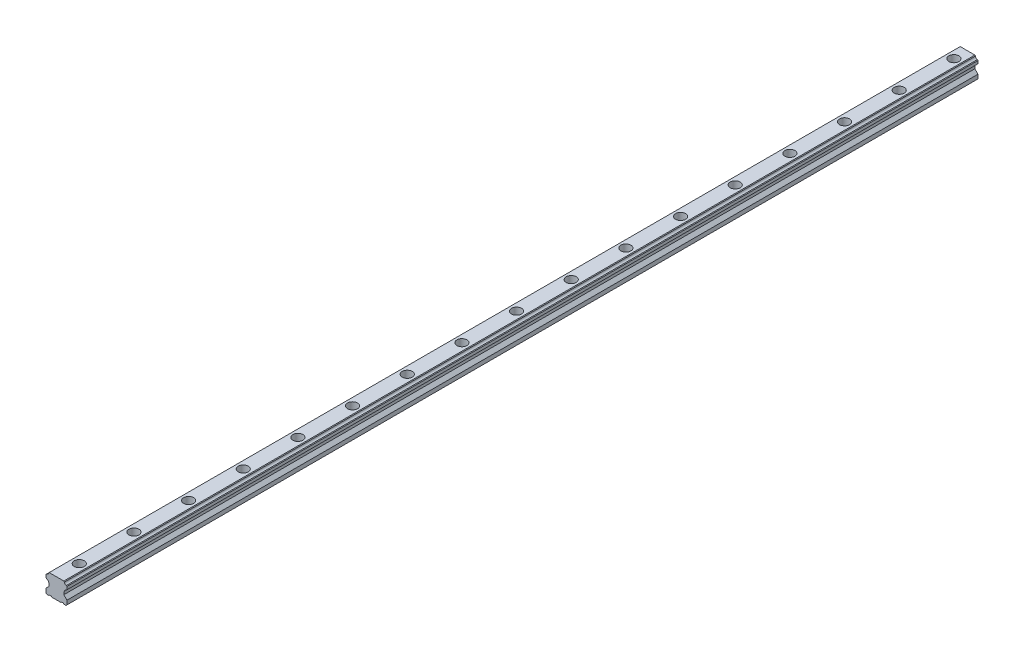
ISO-10303-21;
HEADER;
FILE_DESCRIPTION(('STEP AP214'),'2;1');
FILE_NAME('part.step','',(''),(''),'','','');
FILE_SCHEMA(('AUTOMOTIVE_DESIGN { 1 0 10303 214 1 1 1 1 }'));
ENDSEC;
DATA;
#1=APPLICATION_CONTEXT('core data for automotive mechanical design processes');
#2=APPLICATION_PROTOCOL_DEFINITION('international standard','automotive_design',2000,#1);
#3=PRODUCT_CONTEXT('',#1,'mechanical');
#4=PRODUCT('Part','Part','',(#3));
#5=PRODUCT_RELATED_PRODUCT_CATEGORY('part','',(#4));
#6=PRODUCT_DEFINITION_FORMATION('','',#4);
#7=PRODUCT_DEFINITION_CONTEXT('part definition',#1,'design');
#8=PRODUCT_DEFINITION('design','',#6,#7);
#9=PRODUCT_DEFINITION_SHAPE('','',#8);
#10=(LENGTH_UNIT() NAMED_UNIT(*) SI_UNIT(.MILLI.,.METRE.));
#11=(NAMED_UNIT(*) PLANE_ANGLE_UNIT() SI_UNIT($,.RADIAN.));
#12=(NAMED_UNIT(*) SI_UNIT($,.STERADIAN.) SOLID_ANGLE_UNIT());
#13=UNCERTAINTY_MEASURE_WITH_UNIT(LENGTH_MEASURE(1.E-05),#10,'distance_accuracy_value','');
#14=(GEOMETRIC_REPRESENTATION_CONTEXT(3) GLOBAL_UNCERTAINTY_ASSIGNED_CONTEXT((#13)) GLOBAL_UNIT_ASSIGNED_CONTEXT((#10,
#11,#12)) REPRESENTATION_CONTEXT('',''));
#15=CARTESIAN_POINT('',(0.,0.,0.));
#16=DIRECTION('',(0.,0.,1.));
#17=DIRECTION('',(1.,0.,0.));
#18=AXIS2_PLACEMENT_3D('',#15,#16,#17);
#19=CARTESIAN_POINT('',(7.86231981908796,10.5307995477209,1000.));
#20=DIRECTION('',(0.,-1.,0.));
#21=DIRECTION('',(0.,0.,-1.));
#22=AXIS2_PLACEMENT_3D('',#19,#20,#21);
#23=PLANE('',#22);
#24=CARTESIAN_POINT('',(-0.187680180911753,10.5307995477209,74.9999999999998));
#25=DIRECTION('',(0.,1.,0.));
#26=DIRECTION('',(0.,0.,1.));
#27=AXIS2_PLACEMENT_3D('',#24,#25,#26);
#28=CIRCLE('',#27,5.5);
#29=CARTESIAN_POINT('',(-0.187680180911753,10.5307995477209,80.4999999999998));
#30=VERTEX_POINT('',#29);
#31=EDGE_CURVE('E1488',#30,#30,#28,.T.);
#32=ORIENTED_EDGE('',*,*,#31,.F.);
#33=EDGE_LOOP('',(#32));
#34=FACE_BOUND('',#33,.T.);
#35=CARTESIAN_POINT('',(-0.187680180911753,10.5307995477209,135.));
#36=DIRECTION('',(0.,1.,0.));
#37=DIRECTION('',(0.,0.,1.));
#38=AXIS2_PLACEMENT_3D('',#35,#36,#37);
#39=CIRCLE('',#38,5.5);
#40=CARTESIAN_POINT('',(-0.187680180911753,10.5307995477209,140.5));
#41=VERTEX_POINT('',#40);
#42=EDGE_CURVE('E1502',#41,#41,#39,.T.);
#43=ORIENTED_EDGE('',*,*,#42,.F.);
#44=EDGE_LOOP('',(#43));
#45=FACE_BOUND('',#44,.T.);
#46=CARTESIAN_POINT('',(-0.187680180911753,10.5307995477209,194.999999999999));
#47=DIRECTION('',(0.,1.,0.));
#48=DIRECTION('',(0.,0.,1.));
#49=AXIS2_PLACEMENT_3D('',#46,#47,#48);
#50=CIRCLE('',#49,5.5);
#51=CARTESIAN_POINT('',(-0.187680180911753,10.5307995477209,200.499999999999));
#52=VERTEX_POINT('',#51);
#53=EDGE_CURVE('E1518',#52,#52,#50,.T.);
#54=ORIENTED_EDGE('',*,*,#53,.F.);
#55=EDGE_LOOP('',(#54));
#56=FACE_BOUND('',#55,.T.);
#57=CARTESIAN_POINT('',(-0.187680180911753,10.5307995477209,254.999999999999));
#58=DIRECTION('',(0.,1.,0.));
#59=DIRECTION('',(0.,0.,1.));
#60=AXIS2_PLACEMENT_3D('',#57,#58,#59);
#61=CIRCLE('',#60,5.5);
#62=CARTESIAN_POINT('',(-0.187680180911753,10.5307995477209,260.499999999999));
#63=VERTEX_POINT('',#62);
#64=EDGE_CURVE('E1534',#63,#63,#61,.T.);
#65=ORIENTED_EDGE('',*,*,#64,.F.);
#66=EDGE_LOOP('',(#65));
#67=FACE_BOUND('',#66,.T.);
#68=CARTESIAN_POINT('',(-0.187680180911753,10.5307995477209,314.999999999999));
#69=DIRECTION('',(0.,1.,0.));
#70=DIRECTION('',(0.,0.,1.));
#71=AXIS2_PLACEMENT_3D('',#68,#69,#70);
#72=CIRCLE('',#71,5.5);
#73=CARTESIAN_POINT('',(-0.187680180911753,10.5307995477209,320.499999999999));
#74=VERTEX_POINT('',#73);
#75=EDGE_CURVE('E1550',#74,#74,#72,.T.);
#76=ORIENTED_EDGE('',*,*,#75,.F.);
#77=EDGE_LOOP('',(#76));
#78=FACE_BOUND('',#77,.T.);
#79=CARTESIAN_POINT('',(-0.187680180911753,10.5307995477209,374.999999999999));
#80=DIRECTION('',(0.,1.,0.));
#81=DIRECTION('',(0.,0.,1.));
#82=AXIS2_PLACEMENT_3D('',#79,#80,#81);
#83=CIRCLE('',#82,5.5);
#84=CARTESIAN_POINT('',(-0.187680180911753,10.5307995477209,380.499999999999));
#85=VERTEX_POINT('',#84);
#86=EDGE_CURVE('E1566',#85,#85,#83,.T.);
#87=ORIENTED_EDGE('',*,*,#86,.F.);
#88=EDGE_LOOP('',(#87));
#89=FACE_BOUND('',#88,.T.);
#90=CARTESIAN_POINT('',(-0.187680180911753,10.5307995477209,434.999999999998));
#91=DIRECTION('',(0.,1.,0.));
#92=DIRECTION('',(0.,0.,1.));
#93=AXIS2_PLACEMENT_3D('',#90,#91,#92);
#94=CIRCLE('',#93,5.5);
#95=CARTESIAN_POINT('',(-0.187680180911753,10.5307995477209,440.499999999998));
#96=VERTEX_POINT('',#95);
#97=EDGE_CURVE('E1582',#96,#96,#94,.T.);
#98=ORIENTED_EDGE('',*,*,#97,.F.);
#99=EDGE_LOOP('',(#98));
#100=FACE_BOUND('',#99,.T.);
#101=CARTESIAN_POINT('',(-0.187680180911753,10.5307995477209,494.999999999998));
#102=DIRECTION('',(0.,1.,0.));
#103=DIRECTION('',(0.,0.,1.));
#104=AXIS2_PLACEMENT_3D('',#101,#102,#103);
#105=CIRCLE('',#104,5.5);
#106=CARTESIAN_POINT('',(-0.187680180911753,10.5307995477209,500.499999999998));
#107=VERTEX_POINT('',#106);
#108=EDGE_CURVE('E1598',#107,#107,#105,.T.);
#109=ORIENTED_EDGE('',*,*,#108,.F.);
#110=EDGE_LOOP('',(#109));
#111=FACE_BOUND('',#110,.T.);
#112=CARTESIAN_POINT('',(-0.187680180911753,10.5307995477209,554.999999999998));
#113=DIRECTION('',(0.,1.,0.));
#114=DIRECTION('',(0.,0.,1.));
#115=AXIS2_PLACEMENT_3D('',#112,#113,#114);
#116=CIRCLE('',#115,5.5);
#117=CARTESIAN_POINT('',(-0.187680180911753,10.5307995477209,560.499999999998));
#118=VERTEX_POINT('',#117);
#119=EDGE_CURVE('E1614',#118,#118,#116,.T.);
#120=ORIENTED_EDGE('',*,*,#119,.F.);
#121=EDGE_LOOP('',(#120));
#122=FACE_BOUND('',#121,.T.);
#123=CARTESIAN_POINT('',(-0.187680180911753,10.5307995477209,614.999999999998));
#124=DIRECTION('',(0.,1.,0.));
#125=DIRECTION('',(0.,0.,1.));
#126=AXIS2_PLACEMENT_3D('',#123,#124,#125);
#127=CIRCLE('',#126,5.5);
#128=CARTESIAN_POINT('',(-0.187680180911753,10.5307995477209,620.499999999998));
#129=VERTEX_POINT('',#128);
#130=EDGE_CURVE('E1630',#129,#129,#127,.T.);
#131=ORIENTED_EDGE('',*,*,#130,.F.);
#132=EDGE_LOOP('',(#131));
#133=FACE_BOUND('',#132,.T.);
#134=CARTESIAN_POINT('',(-0.187680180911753,10.5307995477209,674.999999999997));
#135=DIRECTION('',(0.,1.,0.));
#136=DIRECTION('',(0.,0.,1.));
#137=AXIS2_PLACEMENT_3D('',#134,#135,#136);
#138=CIRCLE('',#137,5.5);
#139=CARTESIAN_POINT('',(-0.187680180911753,10.5307995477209,680.499999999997));
#140=VERTEX_POINT('',#139);
#141=EDGE_CURVE('E1646',#140,#140,#138,.T.);
#142=ORIENTED_EDGE('',*,*,#141,.F.);
#143=EDGE_LOOP('',(#142));
#144=FACE_BOUND('',#143,.T.);
#145=CARTESIAN_POINT('',(-0.187680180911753,10.5307995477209,734.999999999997));
#146=DIRECTION('',(0.,1.,0.));
#147=DIRECTION('',(0.,0.,1.));
#148=AXIS2_PLACEMENT_3D('',#145,#146,#147);
#149=CIRCLE('',#148,5.5);
#150=CARTESIAN_POINT('',(-0.187680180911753,10.5307995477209,740.499999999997));
#151=VERTEX_POINT('',#150);
#152=EDGE_CURVE('E1662',#151,#151,#149,.T.);
#153=ORIENTED_EDGE('',*,*,#152,.F.);
#154=EDGE_LOOP('',(#153));
#155=FACE_BOUND('',#154,.T.);
#156=CARTESIAN_POINT('',(-0.187680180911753,10.5307995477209,794.999999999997));
#157=DIRECTION('',(0.,1.,0.));
#158=DIRECTION('',(0.,0.,1.));
#159=AXIS2_PLACEMENT_3D('',#156,#157,#158);
#160=CIRCLE('',#159,5.5);
#161=CARTESIAN_POINT('',(-0.187680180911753,10.5307995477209,800.499999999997));
#162=VERTEX_POINT('',#161);
#163=EDGE_CURVE('E1678',#162,#162,#160,.T.);
#164=ORIENTED_EDGE('',*,*,#163,.F.);
#165=EDGE_LOOP('',(#164));
#166=FACE_BOUND('',#165,.T.);
#167=CARTESIAN_POINT('',(-0.187680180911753,10.5307995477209,854.999999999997));
#168=DIRECTION('',(0.,1.,0.));
#169=DIRECTION('',(0.,0.,1.));
#170=AXIS2_PLACEMENT_3D('',#167,#168,#169);
#171=CIRCLE('',#170,5.5);
#172=CARTESIAN_POINT('',(-0.187680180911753,10.5307995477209,860.499999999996));
#173=VERTEX_POINT('',#172);
#174=EDGE_CURVE('E1694',#173,#173,#171,.T.);
#175=ORIENTED_EDGE('',*,*,#174,.F.);
#176=EDGE_LOOP('',(#175));
#177=FACE_BOUND('',#176,.T.);
#178=CARTESIAN_POINT('',(-0.187680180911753,10.5307995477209,914.999999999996));
#179=DIRECTION('',(0.,1.,0.));
#180=DIRECTION('',(0.,0.,1.));
#181=AXIS2_PLACEMENT_3D('',#178,#179,#180);
#182=CIRCLE('',#181,5.5);
#183=CARTESIAN_POINT('',(-0.187680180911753,10.5307995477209,920.499999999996));
#184=VERTEX_POINT('',#183);
#185=EDGE_CURVE('E1710',#184,#184,#182,.T.);
#186=ORIENTED_EDGE('',*,*,#185,.F.);
#187=EDGE_LOOP('',(#186));
#188=FACE_BOUND('',#187,.T.);
#189=CARTESIAN_POINT('',(-0.187680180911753,10.5307995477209,15.));
#190=DIRECTION('',(0.,1.,0.));
#191=DIRECTION('',(0.,0.,1.));
#192=AXIS2_PLACEMENT_3D('',#189,#190,#191);
#193=CIRCLE('',#192,5.5);
#194=CARTESIAN_POINT('',(-0.187680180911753,10.5307995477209,20.5));
#195=VERTEX_POINT('',#194);
#196=EDGE_CURVE('E1742',#195,#195,#193,.T.);
#197=ORIENTED_EDGE('',*,*,#196,.F.);
#198=EDGE_LOOP('',(#197));
#199=FACE_BOUND('',#198,.T.);
#200=DIRECTION('',(-1.,0.,0.));
#201=VECTOR('',#200,1.);
#202=CARTESIAN_POINT('',(7.86231981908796,10.5307995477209,0.));
#203=LINE('',#202,#201);
#204=CARTESIAN_POINT('',(7.86231981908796,10.5307995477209,0.));
#205=VERTEX_POINT('',#204);
#206=CARTESIAN_POINT('',(-8.23768018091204,10.5307995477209,0.));
#207=VERTEX_POINT('',#206);
#208=EDGE_CURVE('E353',#205,#207,#203,.T.);
#209=ORIENTED_EDGE('',*,*,#208,.T.);
#210=DIRECTION('',(0.,0.,-1.));
#211=VECTOR('',#210,1.);
#212=CARTESIAN_POINT('',(-8.23768018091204,10.5307995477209,1000.));
#213=LINE('',#212,#211);
#214=CARTESIAN_POINT('',(-8.23768018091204,10.5307995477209,1000.));
#215=VERTEX_POINT('',#214);
#216=EDGE_CURVE('E421',#215,#207,#213,.T.);
#217=ORIENTED_EDGE('',*,*,#216,.F.);
#218=DIRECTION('',(-1.,0.,0.));
#219=VECTOR('',#218,1.);
#220=CARTESIAN_POINT('',(7.86231981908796,10.5307995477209,1000.));
#221=LINE('',#220,#219);
#222=CARTESIAN_POINT('',(7.86231981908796,10.5307995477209,1000.));
#223=VERTEX_POINT('',#222);
#224=EDGE_CURVE('E572',#223,#215,#221,.T.);
#225=ORIENTED_EDGE('',*,*,#224,.F.);
#226=DIRECTION('',(0.,0.,-1.));
#227=VECTOR('',#226,1.);
#228=CARTESIAN_POINT('',(7.86231981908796,10.5307995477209,1000.));
#229=LINE('',#228,#227);
#230=EDGE_CURVE('E425',#223,#205,#229,.T.);
#231=ORIENTED_EDGE('',*,*,#230,.T.);
#232=EDGE_LOOP('',(#209,#217,#225,#231));
#233=FACE_BOUND('',#232,.T.);
#234=CARTESIAN_POINT('',(-0.187680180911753,10.5307995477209,974.999999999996));
#235=DIRECTION('',(0.,1.,0.));
#236=DIRECTION('',(0.,0.,1.));
#237=AXIS2_PLACEMENT_3D('',#234,#235,#236);
#238=CIRCLE('',#237,5.5);
#239=CARTESIAN_POINT('',(-0.187680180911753,10.5307995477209,980.499999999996));
#240=VERTEX_POINT('',#239);
#241=EDGE_CURVE('E1726',#240,#240,#238,.T.);
#242=ORIENTED_EDGE('',*,*,#241,.F.);
#243=EDGE_LOOP('',(#242));
#244=FACE_BOUND('',#243,.T.);
#245=ADVANCED_FACE('F45',(#34,#45,#56,#67,#78,#89,#100,#111,#122,#133,#144,#155,#166,#177,#188,
#199,#233,#244),#23,.F.);
#246=CARTESIAN_POINT('',(-10.6876801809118,-11.4692004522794,1000.));
#247=DIRECTION('',(0.,1.,0.));
#248=DIRECTION('',(-1.,0.,0.));
#249=AXIS2_PLACEMENT_3D('',#246,#247,#248);
#250=PLANE('',#249);
#251=DIRECTION('',(1.,0.,0.));
#252=VECTOR('',#251,1.);
#253=CARTESIAN_POINT('',(-10.6876801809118,-11.4692004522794,0.));
#254=LINE('',#253,#252);
#255=CARTESIAN_POINT('',(-10.6876801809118,-11.4692004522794,0.));
#256=VERTEX_POINT('',#255);
#257=CARTESIAN_POINT('',(-8.40196589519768,-11.4692004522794,0.));
#258=VERTEX_POINT('',#257);
#259=EDGE_CURVE('E291',#256,#258,#254,.T.);
#260=ORIENTED_EDGE('',*,*,#259,.T.);
#261=DIRECTION('',(0.,0.,-1.));
#262=VECTOR('',#261,1.);
#263=CARTESIAN_POINT('',(-8.40196589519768,-11.4692004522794,1000.));
#264=LINE('',#263,#262);
#265=CARTESIAN_POINT('',(-8.40196589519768,-11.4692004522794,1000.));
#266=VERTEX_POINT('',#265);
#267=EDGE_CURVE('E12',#266,#258,#264,.T.);
#268=ORIENTED_EDGE('',*,*,#267,.F.);
#269=DIRECTION('',(1.,0.,0.));
#270=VECTOR('',#269,1.);
#271=CARTESIAN_POINT('',(-10.6876801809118,-11.4692004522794,1000.));
#272=LINE('',#271,#270);
#273=CARTESIAN_POINT('',(-10.6876801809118,-11.4692004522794,1000.));
#274=VERTEX_POINT('',#273);
#275=EDGE_CURVE('E386',#274,#266,#272,.T.);
#276=ORIENTED_EDGE('',*,*,#275,.F.);
#277=DIRECTION('',(0.,0.,-1.));
#278=VECTOR('',#277,1.);
#279=CARTESIAN_POINT('',(-10.6876801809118,-11.4692004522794,1000.));
#280=LINE('',#279,#278);
#281=EDGE_CURVE('E287',#274,#256,#280,.T.);
#282=ORIENTED_EDGE('',*,*,#281,.T.);
#283=EDGE_LOOP('',(#260,#268,#276,#282));
#284=FACE_BOUND('',#283,.T.);
#285=ADVANCED_FACE('F47',(#284),#250,.F.);
#286=CARTESIAN_POINT('',(-8.40196589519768,-11.4692004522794,1000.));
#287=DIRECTION('',(-0.707106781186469,0.707106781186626,0.));
#288=DIRECTION('',(-0.707106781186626,-0.707106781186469,0.));
#289=AXIS2_PLACEMENT_3D('',#286,#287,#288);
#290=PLANE('',#289);
#291=DIRECTION('',(0.707106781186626,0.707106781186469,0.));
#292=VECTOR('',#291,1.);
#293=CARTESIAN_POINT('',(-8.40196589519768,-11.4692004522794,0.));
#294=LINE('',#293,#292);
#295=CARTESIAN_POINT('',(-7.63529922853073,-10.7025337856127,0.));
#296=VERTEX_POINT('',#295);
#297=EDGE_CURVE('E295',#258,#296,#294,.T.);
#298=ORIENTED_EDGE('',*,*,#297,.T.);
#299=DIRECTION('',(0.,0.,-1.));
#300=VECTOR('',#299,1.);
#301=CARTESIAN_POINT('',(-7.63529922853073,-10.7025337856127,1000.));
#302=LINE('',#301,#300);
#303=CARTESIAN_POINT('',(-7.63529922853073,-10.7025337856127,1000.));
#304=VERTEX_POINT('',#303);
#305=EDGE_CURVE('E55',#304,#296,#302,.T.);
#306=ORIENTED_EDGE('',*,*,#305,.F.);
#307=DIRECTION('',(0.707106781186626,0.707106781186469,0.));
#308=VECTOR('',#307,1.);
#309=CARTESIAN_POINT('',(-8.40196589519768,-11.4692004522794,1000.));
#310=LINE('',#309,#308);
#311=EDGE_CURVE('E178',#266,#304,#310,.T.);
#312=ORIENTED_EDGE('',*,*,#311,.F.);
#313=ORIENTED_EDGE('',*,*,#267,.T.);
#314=EDGE_LOOP('',(#298,#306,#312,#313));
#315=FACE_BOUND('',#314,.T.);
#316=ADVANCED_FACE('F625',(#315),#290,.F.);
#317=CARTESIAN_POINT('',(-7.63529922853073,-10.7025337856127,1000.));
#318=DIRECTION('',(0.,1.,0.));
#319=DIRECTION('',(-1.,0.,0.));
#320=AXIS2_PLACEMENT_3D('',#317,#318,#319);
#321=PLANE('',#320);
#322=DIRECTION('',(1.,0.,0.));
#323=VECTOR('',#322,1.);
#324=CARTESIAN_POINT('',(-7.63529922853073,-10.7025337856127,0.));
#325=LINE('',#324,#323);
#326=CARTESIAN_POINT('',(-5.88291827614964,-10.7025337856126,0.));
#327=VERTEX_POINT('',#326);
#328=EDGE_CURVE('E299',#296,#327,#325,.T.);
#329=ORIENTED_EDGE('',*,*,#328,.T.);
#330=DIRECTION('',(0.,0.,-1.));
#331=VECTOR('',#330,1.);
#332=CARTESIAN_POINT('',(-5.88291827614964,-10.7025337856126,1000.));
#333=LINE('',#332,#331);
#334=CARTESIAN_POINT('',(-5.88291827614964,-10.7025337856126,1000.));
#335=VERTEX_POINT('',#334);
#336=EDGE_CURVE('E493',#335,#327,#333,.T.);
#337=ORIENTED_EDGE('',*,*,#336,.F.);
#338=DIRECTION('',(1.,0.,0.));
#339=VECTOR('',#338,1.);
#340=CARTESIAN_POINT('',(-7.63529922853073,-10.7025337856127,1000.));
#341=LINE('',#340,#339);
#342=EDGE_CURVE('E503',#304,#335,#341,.T.);
#343=ORIENTED_EDGE('',*,*,#342,.F.);
#344=ORIENTED_EDGE('',*,*,#305,.T.);
#345=EDGE_LOOP('',(#329,#337,#343,#344));
#346=FACE_BOUND('',#345,.T.);
#347=ADVANCED_FACE('F501',(#346),#321,.F.);
#348=CARTESIAN_POINT('',(-5.88291827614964,-10.7025337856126,1000.));
#349=DIRECTION('',(0.707106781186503,0.707106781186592,0.));
#350=DIRECTION('',(-0.707106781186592,0.707106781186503,0.));
#351=AXIS2_PLACEMENT_3D('',#348,#349,#350);
#352=PLANE('',#351);
#353=DIRECTION('',(0.707106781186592,-0.707106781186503,0.));
#354=VECTOR('',#353,1.);
#355=CARTESIAN_POINT('',(-5.88291827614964,-10.7025337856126,0.));
#356=LINE('',#355,#354);
#357=CARTESIAN_POINT('',(-5.11625160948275,-11.4692004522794,0.));
#358=VERTEX_POINT('',#357);
#359=EDGE_CURVE('E302',#327,#358,#356,.T.);
#360=ORIENTED_EDGE('',*,*,#359,.T.);
#361=DIRECTION('',(0.,0.,-1.));
#362=VECTOR('',#361,1.);
#363=CARTESIAN_POINT('',(-5.11625160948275,-11.4692004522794,1000.));
#364=LINE('',#363,#362);
#365=CARTESIAN_POINT('',(-5.11625160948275,-11.4692004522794,1000.));
#366=VERTEX_POINT('',#365);
#367=EDGE_CURVE('E489',#366,#358,#364,.T.);
#368=ORIENTED_EDGE('',*,*,#367,.F.);
#369=DIRECTION('',(0.707106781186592,-0.707106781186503,0.));
#370=VECTOR('',#369,1.);
#371=CARTESIAN_POINT('',(-5.88291827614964,-10.7025337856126,1000.));
#372=LINE('',#371,#370);
#373=EDGE_CURVE('E522',#335,#366,#372,.T.);
#374=ORIENTED_EDGE('',*,*,#373,.F.);
#375=ORIENTED_EDGE('',*,*,#336,.T.);
#376=EDGE_LOOP('',(#360,#368,#374,#375));
#377=FACE_BOUND('',#376,.T.);
#378=ADVANCED_FACE('F512',(#377),#352,.F.);
#379=CARTESIAN_POINT('',(-5.11625160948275,-11.4692004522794,1000.));
#380=DIRECTION('',(0.,1.,0.));
#381=DIRECTION('',(0.,0.,1.));
#382=AXIS2_PLACEMENT_3D('',#379,#380,#381);
#383=PLANE('',#382);
#384=CARTESIAN_POINT('',(-0.187680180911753,-11.4692004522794,74.9999999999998));
#385=DIRECTION('',(0.,1.,0.));
#386=DIRECTION('',(0.,0.,1.));
#387=AXIS2_PLACEMENT_3D('',#384,#385,#386);
#388=CIRCLE('',#387,3.49999999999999);
#389=CARTESIAN_POINT('',(-0.187680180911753,-11.4692004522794,78.4999999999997));
#390=VERTEX_POINT('',#389);
#391=EDGE_CURVE('E1498',#390,#390,#388,.T.);
#392=ORIENTED_EDGE('',*,*,#391,.T.);
#393=EDGE_LOOP('',(#392));
#394=FACE_BOUND('',#393,.T.);
#395=CARTESIAN_POINT('',(-0.187680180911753,-11.4692004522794,135.));
#396=DIRECTION('',(0.,1.,0.));
#397=DIRECTION('',(0.,0.,1.));
#398=AXIS2_PLACEMENT_3D('',#395,#396,#397);
#399=CIRCLE('',#398,3.49999999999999);
#400=CARTESIAN_POINT('',(-0.187680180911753,-11.4692004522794,138.5));
#401=VERTEX_POINT('',#400);
#402=EDGE_CURVE('E1514',#401,#401,#399,.T.);
#403=ORIENTED_EDGE('',*,*,#402,.T.);
#404=EDGE_LOOP('',(#403));
#405=FACE_BOUND('',#404,.T.);
#406=CARTESIAN_POINT('',(-0.187680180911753,-11.4692004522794,194.999999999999));
#407=DIRECTION('',(0.,1.,0.));
#408=DIRECTION('',(0.,0.,1.));
#409=AXIS2_PLACEMENT_3D('',#406,#407,#408);
#410=CIRCLE('',#409,3.49999999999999);
#411=CARTESIAN_POINT('',(-0.187680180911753,-11.4692004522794,198.499999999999));
#412=VERTEX_POINT('',#411);
#413=EDGE_CURVE('E1530',#412,#412,#410,.T.);
#414=ORIENTED_EDGE('',*,*,#413,.T.);
#415=EDGE_LOOP('',(#414));
#416=FACE_BOUND('',#415,.T.);
#417=CARTESIAN_POINT('',(-0.187680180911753,-11.4692004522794,254.999999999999));
#418=DIRECTION('',(0.,1.,0.));
#419=DIRECTION('',(0.,0.,1.));
#420=AXIS2_PLACEMENT_3D('',#417,#418,#419);
#421=CIRCLE('',#420,3.49999999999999);
#422=CARTESIAN_POINT('',(-0.187680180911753,-11.4692004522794,258.499999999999));
#423=VERTEX_POINT('',#422);
#424=EDGE_CURVE('E1546',#423,#423,#421,.T.);
#425=ORIENTED_EDGE('',*,*,#424,.T.);
#426=EDGE_LOOP('',(#425));
#427=FACE_BOUND('',#426,.T.);
#428=CARTESIAN_POINT('',(-0.187680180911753,-11.4692004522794,314.999999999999));
#429=DIRECTION('',(0.,1.,0.));
#430=DIRECTION('',(0.,0.,1.));
#431=AXIS2_PLACEMENT_3D('',#428,#429,#430);
#432=CIRCLE('',#431,3.49999999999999);
#433=CARTESIAN_POINT('',(-0.187680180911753,-11.4692004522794,318.499999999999));
#434=VERTEX_POINT('',#433);
#435=EDGE_CURVE('E1562',#434,#434,#432,.T.);
#436=ORIENTED_EDGE('',*,*,#435,.T.);
#437=EDGE_LOOP('',(#436));
#438=FACE_BOUND('',#437,.T.);
#439=CARTESIAN_POINT('',(-0.187680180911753,-11.4692004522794,374.999999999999));
#440=DIRECTION('',(0.,1.,0.));
#441=DIRECTION('',(0.,0.,1.));
#442=AXIS2_PLACEMENT_3D('',#439,#440,#441);
#443=CIRCLE('',#442,3.49999999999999);
#444=CARTESIAN_POINT('',(-0.187680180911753,-11.4692004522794,378.499999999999));
#445=VERTEX_POINT('',#444);
#446=EDGE_CURVE('E1578',#445,#445,#443,.T.);
#447=ORIENTED_EDGE('',*,*,#446,.T.);
#448=EDGE_LOOP('',(#447));
#449=FACE_BOUND('',#448,.T.);
#450=CARTESIAN_POINT('',(-0.187680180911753,-11.4692004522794,434.999999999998));
#451=DIRECTION('',(0.,1.,0.));
#452=DIRECTION('',(0.,0.,1.));
#453=AXIS2_PLACEMENT_3D('',#450,#451,#452);
#454=CIRCLE('',#453,3.49999999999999);
#455=CARTESIAN_POINT('',(-0.187680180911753,-11.4692004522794,438.499999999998));
#456=VERTEX_POINT('',#455);
#457=EDGE_CURVE('E1594',#456,#456,#454,.T.);
#458=ORIENTED_EDGE('',*,*,#457,.T.);
#459=EDGE_LOOP('',(#458));
#460=FACE_BOUND('',#459,.T.);
#461=CARTESIAN_POINT('',(-0.187680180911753,-11.4692004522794,494.999999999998));
#462=DIRECTION('',(0.,1.,0.));
#463=DIRECTION('',(0.,0.,1.));
#464=AXIS2_PLACEMENT_3D('',#461,#462,#463);
#465=CIRCLE('',#464,3.49999999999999);
#466=CARTESIAN_POINT('',(-0.187680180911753,-11.4692004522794,498.499999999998));
#467=VERTEX_POINT('',#466);
#468=EDGE_CURVE('E1610',#467,#467,#465,.T.);
#469=ORIENTED_EDGE('',*,*,#468,.T.);
#470=EDGE_LOOP('',(#469));
#471=FACE_BOUND('',#470,.T.);
#472=CARTESIAN_POINT('',(-0.187680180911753,-11.4692004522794,554.999999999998));
#473=DIRECTION('',(0.,1.,0.));
#474=DIRECTION('',(0.,0.,1.));
#475=AXIS2_PLACEMENT_3D('',#472,#473,#474);
#476=CIRCLE('',#475,3.49999999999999);
#477=CARTESIAN_POINT('',(-0.187680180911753,-11.4692004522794,558.499999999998));
#478=VERTEX_POINT('',#477);
#479=EDGE_CURVE('E1626',#478,#478,#476,.T.);
#480=ORIENTED_EDGE('',*,*,#479,.T.);
#481=EDGE_LOOP('',(#480));
#482=FACE_BOUND('',#481,.T.);
#483=CARTESIAN_POINT('',(-0.187680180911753,-11.4692004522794,614.999999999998));
#484=DIRECTION('',(0.,1.,0.));
#485=DIRECTION('',(0.,0.,1.));
#486=AXIS2_PLACEMENT_3D('',#483,#484,#485);
#487=CIRCLE('',#486,3.49999999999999);
#488=CARTESIAN_POINT('',(-0.187680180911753,-11.4692004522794,618.499999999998));
#489=VERTEX_POINT('',#488);
#490=EDGE_CURVE('E1642',#489,#489,#487,.T.);
#491=ORIENTED_EDGE('',*,*,#490,.T.);
#492=EDGE_LOOP('',(#491));
#493=FACE_BOUND('',#492,.T.);
#494=CARTESIAN_POINT('',(-0.187680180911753,-11.4692004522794,674.999999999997));
#495=DIRECTION('',(0.,1.,0.));
#496=DIRECTION('',(0.,0.,1.));
#497=AXIS2_PLACEMENT_3D('',#494,#495,#496);
#498=CIRCLE('',#497,3.49999999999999);
#499=CARTESIAN_POINT('',(-0.187680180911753,-11.4692004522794,678.499999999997));
#500=VERTEX_POINT('',#499);
#501=EDGE_CURVE('E1658',#500,#500,#498,.T.);
#502=ORIENTED_EDGE('',*,*,#501,.T.);
#503=EDGE_LOOP('',(#502));
#504=FACE_BOUND('',#503,.T.);
#505=CARTESIAN_POINT('',(-0.187680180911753,-11.4692004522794,734.999999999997));
#506=DIRECTION('',(0.,1.,0.));
#507=DIRECTION('',(0.,0.,1.));
#508=AXIS2_PLACEMENT_3D('',#505,#506,#507);
#509=CIRCLE('',#508,3.49999999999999);
#510=CARTESIAN_POINT('',(-0.187680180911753,-11.4692004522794,738.499999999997));
#511=VERTEX_POINT('',#510);
#512=EDGE_CURVE('E1674',#511,#511,#509,.T.);
#513=ORIENTED_EDGE('',*,*,#512,.T.);
#514=EDGE_LOOP('',(#513));
#515=FACE_BOUND('',#514,.T.);
#516=CARTESIAN_POINT('',(-0.187680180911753,-11.4692004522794,794.999999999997));
#517=DIRECTION('',(0.,1.,0.));
#518=DIRECTION('',(0.,0.,1.));
#519=AXIS2_PLACEMENT_3D('',#516,#517,#518);
#520=CIRCLE('',#519,3.49999999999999);
#521=CARTESIAN_POINT('',(-0.187680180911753,-11.4692004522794,798.499999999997));
#522=VERTEX_POINT('',#521);
#523=EDGE_CURVE('E1690',#522,#522,#520,.T.);
#524=ORIENTED_EDGE('',*,*,#523,.T.);
#525=EDGE_LOOP('',(#524));
#526=FACE_BOUND('',#525,.T.);
#527=CARTESIAN_POINT('',(-0.187680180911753,-11.4692004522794,854.999999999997));
#528=DIRECTION('',(0.,1.,0.));
#529=DIRECTION('',(0.,0.,1.));
#530=AXIS2_PLACEMENT_3D('',#527,#528,#529);
#531=CIRCLE('',#530,3.49999999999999);
#532=CARTESIAN_POINT('',(-0.187680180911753,-11.4692004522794,858.499999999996));
#533=VERTEX_POINT('',#532);
#534=EDGE_CURVE('E1706',#533,#533,#531,.T.);
#535=ORIENTED_EDGE('',*,*,#534,.T.);
#536=EDGE_LOOP('',(#535));
#537=FACE_BOUND('',#536,.T.);
#538=CARTESIAN_POINT('',(-0.187680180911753,-11.4692004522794,914.999999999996));
#539=DIRECTION('',(0.,1.,0.));
#540=DIRECTION('',(0.,0.,1.));
#541=AXIS2_PLACEMENT_3D('',#538,#539,#540);
#542=CIRCLE('',#541,3.49999999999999);
#543=CARTESIAN_POINT('',(-0.187680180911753,-11.4692004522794,918.499999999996));
#544=VERTEX_POINT('',#543);
#545=EDGE_CURVE('E1722',#544,#544,#542,.T.);
#546=ORIENTED_EDGE('',*,*,#545,.T.);
#547=EDGE_LOOP('',(#546));
#548=FACE_BOUND('',#547,.T.);
#549=CARTESIAN_POINT('',(-0.187680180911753,-11.4692004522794,974.999999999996));
#550=DIRECTION('',(0.,1.,0.));
#551=DIRECTION('',(0.,0.,1.));
#552=AXIS2_PLACEMENT_3D('',#549,#550,#551);
#553=CIRCLE('',#552,3.49999999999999);
#554=CARTESIAN_POINT('',(-0.187680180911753,-11.4692004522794,978.499999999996));
#555=VERTEX_POINT('',#554);
#556=EDGE_CURVE('E1738',#555,#555,#553,.T.);
#557=ORIENTED_EDGE('',*,*,#556,.T.);
#558=EDGE_LOOP('',(#557));
#559=FACE_BOUND('',#558,.T.);
#560=CARTESIAN_POINT('',(-0.187680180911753,-11.4692004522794,15.));
#561=DIRECTION('',(0.,1.,0.));
#562=DIRECTION('',(0.,0.,1.));
#563=AXIS2_PLACEMENT_3D('',#560,#561,#562);
#564=CIRCLE('',#563,3.49999999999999);
#565=CARTESIAN_POINT('',(-0.187680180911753,-11.4692004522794,18.5));
#566=VERTEX_POINT('',#565);
#567=EDGE_CURVE('E296',#566,#566,#564,.T.);
#568=ORIENTED_EDGE('',*,*,#567,.T.);
#569=EDGE_LOOP('',(#568));
#570=FACE_BOUND('',#569,.T.);
#571=DIRECTION('',(1.,0.,0.));
#572=VECTOR('',#571,1.);
#573=CARTESIAN_POINT('',(-5.11625160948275,-11.4692004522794,0.));
#574=LINE('',#573,#572);
#575=CARTESIAN_POINT('',(4.74089124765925,-11.4692004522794,0.));
#576=VERTEX_POINT('',#575);
#577=EDGE_CURVE('E305',#358,#576,#574,.T.);
#578=ORIENTED_EDGE('',*,*,#577,.T.);
#579=DIRECTION('',(0.,0.,-1.));
#580=VECTOR('',#579,1.);
#581=CARTESIAN_POINT('',(4.74089124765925,-11.4692004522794,1000.));
#582=LINE('',#581,#580);
#583=CARTESIAN_POINT('',(4.74089124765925,-11.4692004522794,1000.));
#584=VERTEX_POINT('',#583);
#585=EDGE_CURVE('E485',#584,#576,#582,.T.);
#586=ORIENTED_EDGE('',*,*,#585,.F.);
#587=DIRECTION('',(1.,0.,0.));
#588=VECTOR('',#587,1.);
#589=CARTESIAN_POINT('',(-5.11625160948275,-11.4692004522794,1000.));
#590=LINE('',#589,#588);
#591=EDGE_CURVE('E518',#366,#584,#590,.T.);
#592=ORIENTED_EDGE('',*,*,#591,.F.);
#593=ORIENTED_EDGE('',*,*,#367,.T.);
#594=EDGE_LOOP('',(#578,#586,#592,#593));
#595=FACE_BOUND('',#594,.T.);
#596=ADVANCED_FACE('F516',(#394,#405,#416,#427,#438,#449,#460,#471,#482,#493,#504,#515,#526,
#537,#548,#559,#570,#595),#383,.F.);
#597=CARTESIAN_POINT('',(4.74089124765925,-11.4692004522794,1000.));
#598=DIRECTION('',(-0.707106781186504,0.707106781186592,0.));
#599=DIRECTION('',(-0.707106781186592,-0.707106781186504,0.));
#600=AXIS2_PLACEMENT_3D('',#597,#598,#599);
#601=PLANE('',#600);
#602=DIRECTION('',(0.707106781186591,0.707106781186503,0.));
#603=VECTOR('',#602,1.);
#604=CARTESIAN_POINT('',(4.74089124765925,-11.4692004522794,0.));
#605=LINE('',#604,#603);
#606=CARTESIAN_POINT('',(5.50755791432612,-10.7025337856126,0.));
#607=VERTEX_POINT('',#606);
#608=EDGE_CURVE('E308',#576,#607,#605,.T.);
#609=ORIENTED_EDGE('',*,*,#608,.T.);
#610=DIRECTION('',(0.,0.,-1.));
#611=VECTOR('',#610,1.);
#612=CARTESIAN_POINT('',(5.50755791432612,-10.7025337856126,1000.));
#613=LINE('',#612,#611);
#614=CARTESIAN_POINT('',(5.50755791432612,-10.7025337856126,1000.));
#615=VERTEX_POINT('',#614);
#616=EDGE_CURVE('E481',#615,#607,#613,.T.);
#617=ORIENTED_EDGE('',*,*,#616,.F.);
#618=DIRECTION('',(0.707106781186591,0.707106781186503,0.));
#619=VECTOR('',#618,1.);
#620=CARTESIAN_POINT('',(4.74089124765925,-11.4692004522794,1000.));
#621=LINE('',#620,#619);
#622=EDGE_CURVE('E521',#584,#615,#621,.T.);
#623=ORIENTED_EDGE('',*,*,#622,.F.);
#624=ORIENTED_EDGE('',*,*,#585,.T.);
#625=EDGE_LOOP('',(#609,#617,#623,#624));
#626=FACE_BOUND('',#625,.T.);
#627=ADVANCED_FACE('F687',(#626),#601,.F.);
#628=CARTESIAN_POINT('',(5.50755791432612,-10.7025337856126,1000.));
#629=DIRECTION('',(0.,1.,0.));
#630=DIRECTION('',(-1.,0.,0.));
#631=AXIS2_PLACEMENT_3D('',#628,#629,#630);
#632=PLANE('',#631);
#633=DIRECTION('',(1.,0.,0.));
#634=VECTOR('',#633,1.);
#635=CARTESIAN_POINT('',(5.50755791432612,-10.7025337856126,0.));
#636=LINE('',#635,#634);
#637=CARTESIAN_POINT('',(7.25993886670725,-10.7025337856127,0.));
#638=VERTEX_POINT('',#637);
#639=EDGE_CURVE('E311',#607,#638,#636,.T.);
#640=ORIENTED_EDGE('',*,*,#639,.T.);
#641=DIRECTION('',(0.,0.,-1.));
#642=VECTOR('',#641,1.);
#643=CARTESIAN_POINT('',(7.25993886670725,-10.7025337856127,1000.));
#644=LINE('',#643,#642);
#645=CARTESIAN_POINT('',(7.25993886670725,-10.7025337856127,1000.));
#646=VERTEX_POINT('',#645);
#647=EDGE_CURVE('E477',#646,#638,#644,.T.);
#648=ORIENTED_EDGE('',*,*,#647,.F.);
#649=DIRECTION('',(1.,0.,0.));
#650=VECTOR('',#649,1.);
#651=CARTESIAN_POINT('',(5.50755791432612,-10.7025337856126,1000.));
#652=LINE('',#651,#650);
#653=EDGE_CURVE('E526',#615,#646,#652,.T.);
#654=ORIENTED_EDGE('',*,*,#653,.F.);
#655=ORIENTED_EDGE('',*,*,#616,.T.);
#656=EDGE_LOOP('',(#640,#648,#654,#655));
#657=FACE_BOUND('',#656,.T.);
#658=ADVANCED_FACE('F683',(#657),#632,.F.);
#659=CARTESIAN_POINT('',(7.25993886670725,-10.7025337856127,1000.));
#660=DIRECTION('',(0.707106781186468,0.707106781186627,0.));
#661=DIRECTION('',(-0.707106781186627,0.707106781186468,0.));
#662=AXIS2_PLACEMENT_3D('',#659,#660,#661);
#663=PLANE('',#662);
#664=DIRECTION('',(0.707106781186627,-0.707106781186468,0.));
#665=VECTOR('',#664,1.);
#666=CARTESIAN_POINT('',(7.25993886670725,-10.7025337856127,0.));
#667=LINE('',#666,#665);
#668=CARTESIAN_POINT('',(8.02660553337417,-11.4692004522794,0.));
#669=VERTEX_POINT('',#668);
#670=EDGE_CURVE('E314',#638,#669,#667,.T.);
#671=ORIENTED_EDGE('',*,*,#670,.T.);
#672=DIRECTION('',(0.,0.,-1.));
#673=VECTOR('',#672,1.);
#674=CARTESIAN_POINT('',(8.02660553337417,-11.4692004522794,1000.));
#675=LINE('',#674,#673);
#676=CARTESIAN_POINT('',(8.02660553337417,-11.4692004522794,1000.));
#677=VERTEX_POINT('',#676);
#678=EDGE_CURVE('E473',#677,#669,#675,.T.);
#679=ORIENTED_EDGE('',*,*,#678,.F.);
#680=DIRECTION('',(0.707106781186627,-0.707106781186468,0.));
#681=VECTOR('',#680,1.);
#682=CARTESIAN_POINT('',(7.25993886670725,-10.7025337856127,1000.));
#683=LINE('',#682,#681);
#684=EDGE_CURVE('E533',#646,#677,#683,.T.);
#685=ORIENTED_EDGE('',*,*,#684,.F.);
#686=ORIENTED_EDGE('',*,*,#647,.T.);
#687=EDGE_LOOP('',(#671,#679,#685,#686));
#688=FACE_BOUND('',#687,.T.);
#689=ADVANCED_FACE('F679',(#688),#663,.F.);
#690=CARTESIAN_POINT('',(8.02660553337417,-11.4692004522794,1000.));
#691=DIRECTION('',(0.,1.,0.));
#692=DIRECTION('',(-1.,0.,0.));
#693=AXIS2_PLACEMENT_3D('',#690,#691,#692);
#694=PLANE('',#693);
#695=DIRECTION('',(1.,0.,0.));
#696=VECTOR('',#695,1.);
#697=CARTESIAN_POINT('',(8.02660553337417,-11.4692004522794,0.));
#698=LINE('',#697,#696);
#699=CARTESIAN_POINT('',(10.3123198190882,-11.4692004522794,0.));
#700=VERTEX_POINT('',#699);
#701=EDGE_CURVE('E317',#669,#700,#698,.T.);
#702=ORIENTED_EDGE('',*,*,#701,.T.);
#703=DIRECTION('',(0.,0.,-1.));
#704=VECTOR('',#703,1.);
#705=CARTESIAN_POINT('',(10.3123198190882,-11.4692004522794,1000.));
#706=LINE('',#705,#704);
#707=CARTESIAN_POINT('',(10.3123198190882,-11.4692004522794,1000.));
#708=VERTEX_POINT('',#707);
#709=EDGE_CURVE('E469',#708,#700,#706,.T.);
#710=ORIENTED_EDGE('',*,*,#709,.F.);
#711=DIRECTION('',(1.,0.,0.));
#712=VECTOR('',#711,1.);
#713=CARTESIAN_POINT('',(8.02660553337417,-11.4692004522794,1000.));
#714=LINE('',#713,#712);
#715=EDGE_CURVE('E536',#677,#708,#714,.T.);
#716=ORIENTED_EDGE('',*,*,#715,.F.);
#717=ORIENTED_EDGE('',*,*,#678,.T.);
#718=EDGE_LOOP('',(#702,#710,#716,#717));
#719=FACE_BOUND('',#718,.T.);
#720=ADVANCED_FACE('F675',(#719),#694,.F.);
#721=CARTESIAN_POINT('',(10.3123198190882,-11.4692004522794,1000.));
#722=DIRECTION('',(-0.707106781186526,0.707106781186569,0.));
#723=DIRECTION('',(-0.707106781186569,-0.707106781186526,0.));
#724=AXIS2_PLACEMENT_3D('',#721,#722,#723);
#725=PLANE('',#724);
#726=DIRECTION('',(0.707106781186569,0.707106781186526,0.));
#727=VECTOR('',#726,1.);
#728=CARTESIAN_POINT('',(10.3123198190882,-11.4692004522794,0.));
#729=LINE('',#728,#727);
#730=CARTESIAN_POINT('',(11.3123198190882,-10.4692004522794,0.));
#731=VERTEX_POINT('',#730);
#732=EDGE_CURVE('E320',#700,#731,#729,.T.);
#733=ORIENTED_EDGE('',*,*,#732,.T.);
#734=DIRECTION('',(0.,0.,-1.));
#735=VECTOR('',#734,1.);
#736=CARTESIAN_POINT('',(11.3123198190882,-10.4692004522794,1000.));
#737=LINE('',#736,#735);
#738=CARTESIAN_POINT('',(11.3123198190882,-10.4692004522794,1000.));
#739=VERTEX_POINT('',#738);
#740=EDGE_CURVE('E465',#739,#731,#737,.T.);
#741=ORIENTED_EDGE('',*,*,#740,.F.);
#742=DIRECTION('',(0.707106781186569,0.707106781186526,0.));
#743=VECTOR('',#742,1.);
#744=CARTESIAN_POINT('',(10.3123198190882,-11.4692004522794,1000.));
#745=LINE('',#744,#743);
#746=EDGE_CURVE('E539',#708,#739,#745,.T.);
#747=ORIENTED_EDGE('',*,*,#746,.F.);
#748=ORIENTED_EDGE('',*,*,#709,.T.);
#749=EDGE_LOOP('',(#733,#741,#747,#748));
#750=FACE_BOUND('',#749,.T.);
#751=ADVANCED_FACE('F671',(#750),#725,.F.);
#752=CARTESIAN_POINT('',(11.3123198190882,-10.4692004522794,1000.));
#753=DIRECTION('',(-1.,0.,0.));
#754=DIRECTION('',(0.,0.,1.));
#755=AXIS2_PLACEMENT_3D('',#752,#753,#754);
#756=PLANE('',#755);
#757=DIRECTION('',(0.,1.,0.));
#758=VECTOR('',#757,1.);
#759=CARTESIAN_POINT('',(11.3123198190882,-10.4692004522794,0.));
#760=LINE('',#759,#758);
#761=CARTESIAN_POINT('',(11.3123198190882,-5.96920045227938,0.));
#762=VERTEX_POINT('',#761);
#763=EDGE_CURVE('E323',#731,#762,#760,.T.);
#764=ORIENTED_EDGE('',*,*,#763,.T.);
#765=DIRECTION('',(0.,0.,-1.));
#766=VECTOR('',#765,1.);
#767=CARTESIAN_POINT('',(11.3123198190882,-5.96920045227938,1000.));
#768=LINE('',#767,#766);
#769=CARTESIAN_POINT('',(11.3123198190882,-5.96920045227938,1000.));
#770=VERTEX_POINT('',#769);
#771=EDGE_CURVE('E461',#770,#762,#768,.T.);
#772=ORIENTED_EDGE('',*,*,#771,.F.);
#773=DIRECTION('',(0.,1.,0.));
#774=VECTOR('',#773,1.);
#775=CARTESIAN_POINT('',(11.3123198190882,-10.4692004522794,1000.));
#776=LINE('',#775,#774);
#777=EDGE_CURVE('E542',#739,#770,#776,.T.);
#778=ORIENTED_EDGE('',*,*,#777,.F.);
#779=ORIENTED_EDGE('',*,*,#740,.T.);
#780=EDGE_LOOP('',(#764,#772,#778,#779));
#781=FACE_BOUND('',#780,.T.);
#782=ADVANCED_FACE('F667',(#781),#756,.F.);
#783=CARTESIAN_POINT('',(11.3123198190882,-5.96920045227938,1000.));
#784=DIRECTION('',(-0.707106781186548,-0.707106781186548,0.));
#785=DIRECTION('',(0.707106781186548,-0.707106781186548,0.));
#786=AXIS2_PLACEMENT_3D('',#783,#784,#785);
#787=PLANE('',#786);
#788=DIRECTION('',(-0.707106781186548,0.707106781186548,0.));
#789=VECTOR('',#788,1.);
#790=CARTESIAN_POINT('',(11.3123198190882,-5.96920045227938,0.));
#791=LINE('',#790,#789);
#792=CARTESIAN_POINT('',(7.86231981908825,-2.51920045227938,0.));
#793=VERTEX_POINT('',#792);
#794=EDGE_CURVE('E326',#762,#793,#791,.T.);
#795=ORIENTED_EDGE('',*,*,#794,.T.);
#796=DIRECTION('',(0.,0.,-1.));
#797=VECTOR('',#796,1.);
#798=CARTESIAN_POINT('',(7.86231981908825,-2.51920045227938,1000.));
#799=LINE('',#798,#797);
#800=CARTESIAN_POINT('',(7.86231981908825,-2.51920045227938,1000.));
#801=VERTEX_POINT('',#800);
#802=EDGE_CURVE('E457',#801,#793,#799,.T.);
#803=ORIENTED_EDGE('',*,*,#802,.F.);
#804=DIRECTION('',(-0.707106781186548,0.707106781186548,0.));
#805=VECTOR('',#804,1.);
#806=CARTESIAN_POINT('',(11.3123198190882,-5.96920045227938,1000.));
#807=LINE('',#806,#805);
#808=EDGE_CURVE('E545',#770,#801,#807,.T.);
#809=ORIENTED_EDGE('',*,*,#808,.F.);
#810=ORIENTED_EDGE('',*,*,#771,.T.);
#811=EDGE_LOOP('',(#795,#803,#809,#810));
#812=FACE_BOUND('',#811,.T.);
#813=ADVANCED_FACE('F663',(#812),#787,.F.);
#814=CARTESIAN_POINT('',(7.86231981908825,-2.51920045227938,1000.));
#815=DIRECTION('',(-1.,0.,0.));
#816=DIRECTION('',(0.,0.,1.));
#817=AXIS2_PLACEMENT_3D('',#814,#815,#816);
#818=PLANE('',#817);
#819=DIRECTION('',(0.,1.,0.));
#820=VECTOR('',#819,1.);
#821=CARTESIAN_POINT('',(7.86231981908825,-2.51920045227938,0.));
#822=LINE('',#821,#820);
#823=CARTESIAN_POINT('',(7.86231981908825,0.480799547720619,0.));
#824=VERTEX_POINT('',#823);
#825=EDGE_CURVE('E329',#793,#824,#822,.T.);
#826=ORIENTED_EDGE('',*,*,#825,.T.);
#827=DIRECTION('',(0.,0.,-1.));
#828=VECTOR('',#827,1.);
#829=CARTESIAN_POINT('',(7.86231981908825,0.480799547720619,1000.));
#830=LINE('',#829,#828);
#831=CARTESIAN_POINT('',(7.86231981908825,0.480799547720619,1000.));
#832=VERTEX_POINT('',#831);
#833=EDGE_CURVE('E453',#832,#824,#830,.T.);
#834=ORIENTED_EDGE('',*,*,#833,.F.);
#835=DIRECTION('',(0.,1.,0.));
#836=VECTOR('',#835,1.);
#837=CARTESIAN_POINT('',(7.86231981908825,-2.51920045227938,1000.));
#838=LINE('',#837,#836);
#839=EDGE_CURVE('E548',#801,#832,#838,.T.);
#840=ORIENTED_EDGE('',*,*,#839,.F.);
#841=ORIENTED_EDGE('',*,*,#802,.T.);
#842=EDGE_LOOP('',(#826,#834,#840,#841));
#843=FACE_BOUND('',#842,.T.);
#844=ADVANCED_FACE('F659',(#843),#818,.F.);
#845=CARTESIAN_POINT('',(7.86231981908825,0.480799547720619,1000.));
#846=DIRECTION('',(-0.707106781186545,0.70710678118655,0.));
#847=DIRECTION('',(-0.70710678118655,-0.707106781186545,0.));
#848=AXIS2_PLACEMENT_3D('',#845,#846,#847);
#849=PLANE('',#848);
#850=DIRECTION('',(0.70710678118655,0.707106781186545,0.));
#851=VECTOR('',#850,1.);
#852=CARTESIAN_POINT('',(7.86231981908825,0.480799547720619,0.));
#853=LINE('',#852,#851);
#854=CARTESIAN_POINT('',(8.51159332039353,1.1300730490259,0.));
#855=VERTEX_POINT('',#854);
#856=EDGE_CURVE('E332',#824,#855,#853,.T.);
#857=ORIENTED_EDGE('',*,*,#856,.T.);
#858=DIRECTION('',(0.,0.,-1.));
#859=VECTOR('',#858,1.);
#860=CARTESIAN_POINT('',(8.51159332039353,1.1300730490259,1000.));
#861=LINE('',#860,#859);
#862=CARTESIAN_POINT('',(8.51159332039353,1.1300730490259,1000.));
#863=VERTEX_POINT('',#862);
#864=EDGE_CURVE('E449',#863,#855,#861,.T.);
#865=ORIENTED_EDGE('',*,*,#864,.F.);
#866=DIRECTION('',(0.70710678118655,0.707106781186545,0.));
#867=VECTOR('',#866,1.);
#868=CARTESIAN_POINT('',(7.86231981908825,0.480799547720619,1000.));
#869=LINE('',#868,#867);
#870=EDGE_CURVE('E551',#832,#863,#869,.T.);
#871=ORIENTED_EDGE('',*,*,#870,.F.);
#872=ORIENTED_EDGE('',*,*,#833,.T.);
#873=EDGE_LOOP('',(#857,#865,#871,#872));
#874=FACE_BOUND('',#873,.T.);
#875=ADVANCED_FACE('F655',(#874),#849,.F.);
#876=CARTESIAN_POINT('',(10.8070790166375,0.986040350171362,1000.));
#877=DIRECTION('',(0.,0.,-1.));
#878=DIRECTION('',(-1.,0.,0.));
#879=AXIS2_PLACEMENT_3D('',#876,#877,#878);
#880=CYLINDRICAL_SURFACE('',#879,2.3);
#881=CARTESIAN_POINT('',(10.8070790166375,0.986040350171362,0.));
#882=DIRECTION('',(0.,0.,-1.));
#883=DIRECTION('',(1.,0.,0.));
#884=AXIS2_PLACEMENT_3D('',#881,#882,#883);
#885=CIRCLE('',#884,2.3);
#886=CARTESIAN_POINT('',(10.663046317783,3.28152604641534,0.));
#887=VERTEX_POINT('',#886);
#888=EDGE_CURVE('E335',#855,#887,#885,.T.);
#889=ORIENTED_EDGE('',*,*,#888,.T.);
#890=DIRECTION('',(0.,0.,-1.));
#891=VECTOR('',#890,1.);
#892=CARTESIAN_POINT('',(10.663046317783,3.28152604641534,1000.));
#893=LINE('',#892,#891);
#894=CARTESIAN_POINT('',(10.663046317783,3.28152604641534,1000.));
#895=VERTEX_POINT('',#894);
#896=EDGE_CURVE('E445',#895,#887,#893,.T.);
#897=ORIENTED_EDGE('',*,*,#896,.F.);
#898=CARTESIAN_POINT('',(10.8070790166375,0.986040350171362,1000.));
#899=DIRECTION('',(0.,0.,-1.));
#900=DIRECTION('',(1.,0.,0.));
#901=AXIS2_PLACEMENT_3D('',#898,#899,#900);
#902=CIRCLE('',#901,2.3);
#903=EDGE_CURVE('E554',#863,#895,#902,.T.);
#904=ORIENTED_EDGE('',*,*,#903,.F.);
#905=ORIENTED_EDGE('',*,*,#864,.T.);
#906=EDGE_LOOP('',(#889,#897,#904,#905));
#907=FACE_BOUND('',#906,.T.);
#908=ADVANCED_FACE('F651',(#907),#880,.F.);
#909=CARTESIAN_POINT('',(10.663046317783,3.28152604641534,1000.));
#910=DIRECTION('',(-0.70710678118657,0.707106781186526,0.));
#911=DIRECTION('',(-0.707106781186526,-0.70710678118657,0.));
#912=AXIS2_PLACEMENT_3D('',#909,#910,#911);
#913=PLANE('',#912);
#914=DIRECTION('',(0.707106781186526,0.70710678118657,0.));
#915=VECTOR('',#914,1.);
#916=CARTESIAN_POINT('',(10.663046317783,3.28152604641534,0.));
#917=LINE('',#916,#915);
#918=CARTESIAN_POINT('',(11.3123198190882,3.93079954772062,0.));
#919=VERTEX_POINT('',#918);
#920=EDGE_CURVE('E338',#887,#919,#917,.T.);
#921=ORIENTED_EDGE('',*,*,#920,.T.);
#922=DIRECTION('',(0.,0.,-1.));
#923=VECTOR('',#922,1.);
#924=CARTESIAN_POINT('',(11.3123198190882,3.93079954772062,1000.));
#925=LINE('',#924,#923);
#926=CARTESIAN_POINT('',(11.3123198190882,3.93079954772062,1000.));
#927=VERTEX_POINT('',#926);
#928=EDGE_CURVE('E441',#927,#919,#925,.T.);
#929=ORIENTED_EDGE('',*,*,#928,.F.);
#930=DIRECTION('',(0.707106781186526,0.70710678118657,0.));
#931=VECTOR('',#930,1.);
#932=CARTESIAN_POINT('',(10.663046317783,3.28152604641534,1000.));
#933=LINE('',#932,#931);
#934=EDGE_CURVE('E557',#895,#927,#933,.T.);
#935=ORIENTED_EDGE('',*,*,#934,.F.);
#936=ORIENTED_EDGE('',*,*,#896,.T.);
#937=EDGE_LOOP('',(#921,#929,#935,#936));
#938=FACE_BOUND('',#937,.T.);
#939=ADVANCED_FACE('F647',(#938),#913,.F.);
#940=CARTESIAN_POINT('',(11.3123198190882,3.93079954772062,1000.));
#941=DIRECTION('',(-1.,0.,0.));
#942=DIRECTION('',(0.,0.,1.));
#943=AXIS2_PLACEMENT_3D('',#940,#941,#942);
#944=PLANE('',#943);
#945=DIRECTION('',(0.,1.,0.));
#946=VECTOR('',#945,1.);
#947=CARTESIAN_POINT('',(11.3123198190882,3.93079954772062,0.));
#948=LINE('',#947,#946);
#949=CARTESIAN_POINT('',(11.3123198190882,7.08079954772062,0.));
#950=VERTEX_POINT('',#949);
#951=EDGE_CURVE('E341',#919,#950,#948,.T.);
#952=ORIENTED_EDGE('',*,*,#951,.T.);
#953=DIRECTION('',(0.,0.,-1.));
#954=VECTOR('',#953,1.);
#955=CARTESIAN_POINT('',(11.3123198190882,7.08079954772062,1000.));
#956=LINE('',#955,#954);
#957=CARTESIAN_POINT('',(11.3123198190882,7.08079954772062,1000.));
#958=VERTEX_POINT('',#957);
#959=EDGE_CURVE('E437',#958,#950,#956,.T.);
#960=ORIENTED_EDGE('',*,*,#959,.F.);
#961=DIRECTION('',(0.,1.,0.));
#962=VECTOR('',#961,1.);
#963=CARTESIAN_POINT('',(11.3123198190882,3.93079954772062,1000.));
#964=LINE('',#963,#962);
#965=EDGE_CURVE('E560',#927,#958,#964,.T.);
#966=ORIENTED_EDGE('',*,*,#965,.F.);
#967=ORIENTED_EDGE('',*,*,#928,.T.);
#968=EDGE_LOOP('',(#952,#960,#966,#967));
#969=FACE_BOUND('',#968,.T.);
#970=ADVANCED_FACE('F643',(#969),#944,.F.);
#971=CARTESIAN_POINT('',(11.3123198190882,7.08079954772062,1000.));
#972=DIRECTION('',(-0.707106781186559,-0.707106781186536,0.));
#973=DIRECTION('',(0.707106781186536,-0.707106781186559,0.));
#974=AXIS2_PLACEMENT_3D('',#971,#972,#973);
#975=PLANE('',#974);
#976=DIRECTION('',(-0.707106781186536,0.707106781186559,0.));
#977=VECTOR('',#976,1.);
#978=CARTESIAN_POINT('',(11.3123198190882,7.08079954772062,0.));
#979=LINE('',#978,#977);
#980=CARTESIAN_POINT('',(10.663046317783,7.7300730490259,0.));
#981=VERTEX_POINT('',#980);
#982=EDGE_CURVE('E344',#950,#981,#979,.T.);
#983=ORIENTED_EDGE('',*,*,#982,.T.);
#984=DIRECTION('',(0.,0.,-1.));
#985=VECTOR('',#984,1.);
#986=CARTESIAN_POINT('',(10.663046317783,7.7300730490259,1000.));
#987=LINE('',#986,#985);
#988=CARTESIAN_POINT('',(10.663046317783,7.7300730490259,1000.));
#989=VERTEX_POINT('',#988);
#990=EDGE_CURVE('E433',#989,#981,#987,.T.);
#991=ORIENTED_EDGE('',*,*,#990,.F.);
#992=DIRECTION('',(-0.707106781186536,0.707106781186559,0.));
#993=VECTOR('',#992,1.);
#994=CARTESIAN_POINT('',(11.3123198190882,7.08079954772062,1000.));
#995=LINE('',#994,#993);
#996=EDGE_CURVE('E563',#958,#989,#995,.T.);
#997=ORIENTED_EDGE('',*,*,#996,.F.);
#998=ORIENTED_EDGE('',*,*,#959,.T.);
#999=EDGE_LOOP('',(#983,#991,#997,#998));
#1000=FACE_BOUND('',#999,.T.);
#1001=ADVANCED_FACE('F639',(#1000),#975,.F.);
#1002=CARTESIAN_POINT('',(10.8070790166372,10.0255587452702,1000.));
#1003=DIRECTION('',(0.,0.,-1.));
#1004=DIRECTION('',(-1.,0.,0.));
#1005=AXIS2_PLACEMENT_3D('',#1002,#1003,#1004);
#1006=CYLINDRICAL_SURFACE('',#1005,2.30000000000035);
#1007=CARTESIAN_POINT('',(10.8070790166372,10.0255587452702,0.));
#1008=DIRECTION('',(0.,0.,-1.));
#1009=DIRECTION('',(1.,0.,0.));
#1010=AXIS2_PLACEMENT_3D('',#1007,#1008,#1009);
#1011=CIRCLE('',#1010,2.30000000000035);
#1012=CARTESIAN_POINT('',(8.51159332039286,9.881526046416,0.));
#1013=VERTEX_POINT('',#1012);
#1014=EDGE_CURVE('E347',#981,#1013,#1011,.T.);
#1015=ORIENTED_EDGE('',*,*,#1014,.T.);
#1016=DIRECTION('',(0.,0.,-1.));
#1017=VECTOR('',#1016,1.);
#1018=CARTESIAN_POINT('',(8.51159332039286,9.881526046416,1000.));
#1019=LINE('',#1018,#1017);
#1020=CARTESIAN_POINT('',(8.51159332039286,9.881526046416,1000.));
#1021=VERTEX_POINT('',#1020);
#1022=EDGE_CURVE('E429',#1021,#1013,#1019,.T.);
#1023=ORIENTED_EDGE('',*,*,#1022,.F.);
#1024=CARTESIAN_POINT('',(10.8070790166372,10.0255587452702,1000.));
#1025=DIRECTION('',(0.,0.,-1.));
#1026=DIRECTION('',(1.,0.,0.));
#1027=AXIS2_PLACEMENT_3D('',#1024,#1025,#1026);
#1028=CIRCLE('',#1027,2.30000000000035);
#1029=EDGE_CURVE('E566',#989,#1021,#1028,.T.);
#1030=ORIENTED_EDGE('',*,*,#1029,.F.);
#1031=ORIENTED_EDGE('',*,*,#990,.T.);
#1032=EDGE_LOOP('',(#1015,#1023,#1030,#1031));
#1033=FACE_BOUND('',#1032,.T.);
#1034=ADVANCED_FACE('F635',(#1033),#1006,.F.);
#1035=CARTESIAN_POINT('',(8.51159332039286,9.881526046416,1000.));
#1036=DIRECTION('',(-0.707106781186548,-0.707106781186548,0.));
#1037=DIRECTION('',(0.707106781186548,-0.707106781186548,0.));
#1038=AXIS2_PLACEMENT_3D('',#1035,#1036,#1037);
#1039=PLANE('',#1038);
#1040=DIRECTION('',(-0.707106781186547,0.707106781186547,0.));
#1041=VECTOR('',#1040,1.);
#1042=CARTESIAN_POINT('',(8.51159332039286,9.881526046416,0.));
#1043=LINE('',#1042,#1041);
#1044=EDGE_CURVE('E350',#1013,#205,#1043,.T.);
#1045=ORIENTED_EDGE('',*,*,#1044,.T.);
#1046=ORIENTED_EDGE('',*,*,#230,.F.);
#1047=DIRECTION('',(-0.707106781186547,0.707106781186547,0.));
#1048=VECTOR('',#1047,1.);
#1049=CARTESIAN_POINT('',(8.51159332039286,9.881526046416,1000.));
#1050=LINE('',#1049,#1048);
#1051=EDGE_CURVE('E569',#1021,#223,#1050,.T.);
#1052=ORIENTED_EDGE('',*,*,#1051,.F.);
#1053=ORIENTED_EDGE('',*,*,#1022,.T.);
#1054=EDGE_LOOP('',(#1045,#1046,#1052,#1053));
#1055=FACE_BOUND('',#1054,.T.);
#1056=ADVANCED_FACE('F632',(#1055),#1039,.F.);
#1057=CARTESIAN_POINT('',(-8.23768018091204,10.5307995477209,1000.));
#1058=DIRECTION('',(0.707106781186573,-0.707106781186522,0.));
#1059=DIRECTION('',(0.707106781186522,0.707106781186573,0.));
#1060=AXIS2_PLACEMENT_3D('',#1057,#1058,#1059);
#1061=PLANE('',#1060);
#1062=DIRECTION('',(-0.707106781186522,-0.707106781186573,0.));
#1063=VECTOR('',#1062,1.);
#1064=CARTESIAN_POINT('',(-8.23768018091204,10.5307995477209,0.));
#1065=LINE('',#1064,#1063);
#1066=CARTESIAN_POINT('',(-8.88695368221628,9.88152604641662,0.));
#1067=VERTEX_POINT('',#1066);
#1068=EDGE_CURVE('E356',#207,#1067,#1065,.T.);
#1069=ORIENTED_EDGE('',*,*,#1068,.T.);
#1070=DIRECTION('',(0.,0.,-1.));
#1071=VECTOR('',#1070,1.);
#1072=CARTESIAN_POINT('',(-8.88695368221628,9.88152604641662,1000.));
#1073=LINE('',#1072,#1071);
#1074=CARTESIAN_POINT('',(-8.88695368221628,9.88152604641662,1000.));
#1075=VERTEX_POINT('',#1074);
#1076=EDGE_CURVE('E417',#1075,#1067,#1073,.T.);
#1077=ORIENTED_EDGE('',*,*,#1076,.F.);
#1078=DIRECTION('',(-0.707106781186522,-0.707106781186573,0.));
#1079=VECTOR('',#1078,1.);
#1080=CARTESIAN_POINT('',(-8.23768018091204,10.5307995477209,1000.));
#1081=LINE('',#1080,#1079);
#1082=EDGE_CURVE('E575',#215,#1075,#1081,.T.);
#1083=ORIENTED_EDGE('',*,*,#1082,.F.);
#1084=ORIENTED_EDGE('',*,*,#216,.T.);
#1085=EDGE_LOOP('',(#1069,#1077,#1083,#1084));
#1086=FACE_BOUND('',#1085,.T.);
#1087=ADVANCED_FACE('F630',(#1086),#1061,.F.);
#1088=CARTESIAN_POINT('',(-11.1824393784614,10.0255587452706,1000.));
#1089=DIRECTION('',(0.,0.,-1.));
#1090=DIRECTION('',(-1.,0.,0.));
#1091=AXIS2_PLACEMENT_3D('',#1088,#1089,#1090);
#1092=CYLINDRICAL_SURFACE('',#1091,2.3000000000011);
#1093=CARTESIAN_POINT('',(-11.1824393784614,10.0255587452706,0.));
#1094=DIRECTION('',(0.,0.,-1.));
#1095=DIRECTION('',(1.,0.,0.));
#1096=AXIS2_PLACEMENT_3D('',#1093,#1094,#1095);
#1097=CIRCLE('',#1096,2.3000000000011);
#1098=CARTESIAN_POINT('',(-11.0384066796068,7.73007304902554,0.));
#1099=VERTEX_POINT('',#1098);
#1100=EDGE_CURVE('E359',#1067,#1099,#1097,.T.);
#1101=ORIENTED_EDGE('',*,*,#1100,.T.);
#1102=DIRECTION('',(0.,0.,-1.));
#1103=VECTOR('',#1102,1.);
#1104=CARTESIAN_POINT('',(-11.0384066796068,7.73007304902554,1000.));
#1105=LINE('',#1104,#1103);
#1106=CARTESIAN_POINT('',(-11.0384066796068,7.73007304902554,1000.));
#1107=VERTEX_POINT('',#1106);
#1108=EDGE_CURVE('E413',#1107,#1099,#1105,.T.);
#1109=ORIENTED_EDGE('',*,*,#1108,.F.);
#1110=CARTESIAN_POINT('',(-11.1824393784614,10.0255587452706,1000.));
#1111=DIRECTION('',(0.,0.,-1.));
#1112=DIRECTION('',(1.,0.,0.));
#1113=AXIS2_PLACEMENT_3D('',#1110,#1111,#1112);
#1114=CIRCLE('',#1113,2.3000000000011);
#1115=EDGE_CURVE('E578',#1075,#1107,#1114,.T.);
#1116=ORIENTED_EDGE('',*,*,#1115,.F.);
#1117=ORIENTED_EDGE('',*,*,#1076,.T.);
#1118=EDGE_LOOP('',(#1101,#1109,#1116,#1117));
#1119=FACE_BOUND('',#1118,.T.);
#1120=ADVANCED_FACE('F782',(#1119),#1092,.F.);
#1121=CARTESIAN_POINT('',(-11.0384066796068,7.73007304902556,1000.));
#1122=DIRECTION('',(0.707106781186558,-0.707106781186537,0.));
#1123=DIRECTION('',(0.707106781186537,0.707106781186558,0.));
#1124=AXIS2_PLACEMENT_3D('',#1121,#1122,#1123);
#1125=PLANE('',#1124);
#1126=DIRECTION('',(-0.707106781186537,-0.707106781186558,0.));
#1127=VECTOR('',#1126,1.);
#1128=CARTESIAN_POINT('',(-11.0384066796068,7.73007304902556,0.));
#1129=LINE('',#1128,#1127);
#1130=CARTESIAN_POINT('',(-11.6876801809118,7.08079954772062,0.));
#1131=VERTEX_POINT('',#1130);
#1132=EDGE_CURVE('E362',#1099,#1131,#1129,.T.);
#1133=ORIENTED_EDGE('',*,*,#1132,.T.);
#1134=DIRECTION('',(0.,0.,-1.));
#1135=VECTOR('',#1134,1.);
#1136=CARTESIAN_POINT('',(-11.6876801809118,7.08079954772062,1000.));
#1137=LINE('',#1136,#1135);
#1138=CARTESIAN_POINT('',(-11.6876801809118,7.08079954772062,1000.));
#1139=VERTEX_POINT('',#1138);
#1140=EDGE_CURVE('E409',#1139,#1131,#1137,.T.);
#1141=ORIENTED_EDGE('',*,*,#1140,.F.);
#1142=DIRECTION('',(-0.707106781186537,-0.707106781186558,0.));
#1143=VECTOR('',#1142,1.);
#1144=CARTESIAN_POINT('',(-11.0384066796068,7.73007304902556,1000.));
#1145=LINE('',#1144,#1143);
#1146=EDGE_CURVE('E581',#1107,#1139,#1145,.T.);
#1147=ORIENTED_EDGE('',*,*,#1146,.F.);
#1148=ORIENTED_EDGE('',*,*,#1108,.T.);
#1149=EDGE_LOOP('',(#1133,#1141,#1147,#1148));
#1150=FACE_BOUND('',#1149,.T.);
#1151=ADVANCED_FACE('F789',(#1150),#1125,.F.);
#1152=CARTESIAN_POINT('',(-11.6876801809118,7.08079954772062,1000.));
#1153=DIRECTION('',(1.,0.,0.));
#1154=DIRECTION('',(0.,0.,-1.));
#1155=AXIS2_PLACEMENT_3D('',#1152,#1153,#1154);
#1156=PLANE('',#1155);
#1157=DIRECTION('',(0.,-1.,0.));
#1158=VECTOR('',#1157,1.);
#1159=CARTESIAN_POINT('',(-11.6876801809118,7.08079954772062,0.));
#1160=LINE('',#1159,#1158);
#1161=CARTESIAN_POINT('',(-11.6876801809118,3.93079954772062,0.));
#1162=VERTEX_POINT('',#1161);
#1163=EDGE_CURVE('E365',#1131,#1162,#1160,.T.);
#1164=ORIENTED_EDGE('',*,*,#1163,.T.);
#1165=DIRECTION('',(0.,0.,-1.));
#1166=VECTOR('',#1165,1.);
#1167=CARTESIAN_POINT('',(-11.6876801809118,3.93079954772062,1000.));
#1168=LINE('',#1167,#1166);
#1169=CARTESIAN_POINT('',(-11.6876801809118,3.93079954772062,1000.));
#1170=VERTEX_POINT('',#1169);
#1171=EDGE_CURVE('E405',#1170,#1162,#1168,.T.);
#1172=ORIENTED_EDGE('',*,*,#1171,.F.);
#1173=DIRECTION('',(0.,-1.,0.));
#1174=VECTOR('',#1173,1.);
#1175=CARTESIAN_POINT('',(-11.6876801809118,7.08079954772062,1000.));
#1176=LINE('',#1175,#1174);
#1177=EDGE_CURVE('E584',#1139,#1170,#1176,.T.);
#1178=ORIENTED_EDGE('',*,*,#1177,.F.);
#1179=ORIENTED_EDGE('',*,*,#1140,.T.);
#1180=EDGE_LOOP('',(#1164,#1172,#1178,#1179));
#1181=FACE_BOUND('',#1180,.T.);
#1182=ADVANCED_FACE('F796',(#1181),#1156,.F.);
#1183=CARTESIAN_POINT('',(-11.6876801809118,3.93079954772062,1000.));
#1184=DIRECTION('',(0.707106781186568,0.707106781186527,0.));
#1185=DIRECTION('',(-0.707106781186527,0.707106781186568,0.));
#1186=AXIS2_PLACEMENT_3D('',#1183,#1184,#1185);
#1187=PLANE('',#1186);
#1188=DIRECTION('',(0.707106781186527,-0.707106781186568,0.));
#1189=VECTOR('',#1188,1.);
#1190=CARTESIAN_POINT('',(-11.6876801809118,3.93079954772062,0.));
#1191=LINE('',#1190,#1189);
#1192=CARTESIAN_POINT('',(-11.0384066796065,3.28152604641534,0.));
#1193=VERTEX_POINT('',#1192);
#1194=EDGE_CURVE('E368',#1162,#1193,#1191,.T.);
#1195=ORIENTED_EDGE('',*,*,#1194,.T.);
#1196=DIRECTION('',(0.,0.,-1.));
#1197=VECTOR('',#1196,1.);
#1198=CARTESIAN_POINT('',(-11.0384066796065,3.28152604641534,1000.));
#1199=LINE('',#1198,#1197);
#1200=CARTESIAN_POINT('',(-11.0384066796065,3.28152604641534,1000.));
#1201=VERTEX_POINT('',#1200);
#1202=EDGE_CURVE('E401',#1201,#1193,#1199,.T.);
#1203=ORIENTED_EDGE('',*,*,#1202,.F.);
#1204=DIRECTION('',(0.707106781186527,-0.707106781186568,0.));
#1205=VECTOR('',#1204,1.);
#1206=CARTESIAN_POINT('',(-11.6876801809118,3.93079954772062,1000.));
#1207=LINE('',#1206,#1205);
#1208=EDGE_CURVE('E587',#1170,#1201,#1207,.T.);
#1209=ORIENTED_EDGE('',*,*,#1208,.F.);
#1210=ORIENTED_EDGE('',*,*,#1171,.T.);
#1211=EDGE_LOOP('',(#1195,#1203,#1209,#1210));
#1212=FACE_BOUND('',#1211,.T.);
#1213=ADVANCED_FACE('F804',(#1212),#1187,.F.);
#1214=CARTESIAN_POINT('',(-11.182439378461,0.986040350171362,1000.));
#1215=DIRECTION('',(0.,0.,-1.));
#1216=DIRECTION('',(-1.,0.,0.));
#1217=AXIS2_PLACEMENT_3D('',#1214,#1215,#1216);
#1218=CYLINDRICAL_SURFACE('',#1217,2.3);
#1219=CARTESIAN_POINT('',(-11.182439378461,0.986040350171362,0.));
#1220=DIRECTION('',(0.,0.,-1.));
#1221=DIRECTION('',(1.,0.,0.));
#1222=AXIS2_PLACEMENT_3D('',#1219,#1220,#1221);
#1223=CIRCLE('',#1222,2.3);
#1224=CARTESIAN_POINT('',(-8.88695368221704,1.1300730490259,0.));
#1225=VERTEX_POINT('',#1224);
#1226=EDGE_CURVE('E371',#1193,#1225,#1223,.T.);
#1227=ORIENTED_EDGE('',*,*,#1226,.T.);
#1228=DIRECTION('',(0.,0.,-1.));
#1229=VECTOR('',#1228,1.);
#1230=CARTESIAN_POINT('',(-8.88695368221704,1.1300730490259,1000.));
#1231=LINE('',#1230,#1229);
#1232=CARTESIAN_POINT('',(-8.88695368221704,1.1300730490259,1000.));
#1233=VERTEX_POINT('',#1232);
#1234=EDGE_CURVE('E397',#1233,#1225,#1231,.T.);
#1235=ORIENTED_EDGE('',*,*,#1234,.F.);
#1236=CARTESIAN_POINT('',(-11.182439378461,0.986040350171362,1000.));
#1237=DIRECTION('',(0.,0.,-1.));
#1238=DIRECTION('',(1.,0.,0.));
#1239=AXIS2_PLACEMENT_3D('',#1236,#1237,#1238);
#1240=CIRCLE('',#1239,2.3);
#1241=EDGE_CURVE('E590',#1201,#1233,#1240,.T.);
#1242=ORIENTED_EDGE('',*,*,#1241,.F.);
#1243=ORIENTED_EDGE('',*,*,#1202,.T.);
#1244=EDGE_LOOP('',(#1227,#1235,#1242,#1243));
#1245=FACE_BOUND('',#1244,.T.);
#1246=ADVANCED_FACE('F812',(#1245),#1218,.F.);
#1247=CARTESIAN_POINT('',(-8.88695368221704,1.1300730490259,1000.));
#1248=DIRECTION('',(0.707106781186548,0.707106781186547,0.));
#1249=DIRECTION('',(-0.707106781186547,0.707106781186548,0.));
#1250=AXIS2_PLACEMENT_3D('',#1247,#1248,#1249);
#1251=PLANE('',#1250);
#1252=DIRECTION('',(0.707106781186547,-0.707106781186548,0.));
#1253=VECTOR('',#1252,1.);
#1254=CARTESIAN_POINT('',(-8.88695368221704,1.1300730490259,0.));
#1255=LINE('',#1254,#1253);
#1256=CARTESIAN_POINT('',(-8.23768018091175,0.480799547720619,0.));
#1257=VERTEX_POINT('',#1256);
#1258=EDGE_CURVE('E374',#1225,#1257,#1255,.T.);
#1259=ORIENTED_EDGE('',*,*,#1258,.T.);
#1260=DIRECTION('',(0.,0.,-1.));
#1261=VECTOR('',#1260,1.);
#1262=CARTESIAN_POINT('',(-8.23768018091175,0.480799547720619,1000.));
#1263=LINE('',#1262,#1261);
#1264=CARTESIAN_POINT('',(-8.23768018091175,0.480799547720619,1000.));
#1265=VERTEX_POINT('',#1264);
#1266=EDGE_CURVE('E393',#1265,#1257,#1263,.T.);
#1267=ORIENTED_EDGE('',*,*,#1266,.F.);
#1268=DIRECTION('',(0.707106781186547,-0.707106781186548,0.));
#1269=VECTOR('',#1268,1.);
#1270=CARTESIAN_POINT('',(-8.88695368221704,1.1300730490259,1000.));
#1271=LINE('',#1270,#1269);
#1272=EDGE_CURVE('E593',#1233,#1265,#1271,.T.);
#1273=ORIENTED_EDGE('',*,*,#1272,.F.);
#1274=ORIENTED_EDGE('',*,*,#1234,.T.);
#1275=EDGE_LOOP('',(#1259,#1267,#1273,#1274));
#1276=FACE_BOUND('',#1275,.T.);
#1277=ADVANCED_FACE('F601',(#1276),#1251,.F.);
#1278=CARTESIAN_POINT('',(-8.23768018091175,0.480799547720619,1000.));
#1279=DIRECTION('',(1.,0.,0.));
#1280=DIRECTION('',(0.,0.,-1.));
#1281=AXIS2_PLACEMENT_3D('',#1278,#1279,#1280);
#1282=PLANE('',#1281);
#1283=DIRECTION('',(0.,-1.,0.));
#1284=VECTOR('',#1283,1.);
#1285=CARTESIAN_POINT('',(-8.23768018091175,0.480799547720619,0.));
#1286=LINE('',#1285,#1284);
#1287=CARTESIAN_POINT('',(-8.23768018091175,-2.51920045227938,0.));
#1288=VERTEX_POINT('',#1287);
#1289=EDGE_CURVE('E377',#1257,#1288,#1286,.T.);
#1290=ORIENTED_EDGE('',*,*,#1289,.T.);
#1291=DIRECTION('',(0.,0.,-1.));
#1292=VECTOR('',#1291,1.);
#1293=CARTESIAN_POINT('',(-8.23768018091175,-2.51920045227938,1000.));
#1294=LINE('',#1293,#1292);
#1295=CARTESIAN_POINT('',(-8.23768018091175,-2.51920045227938,1000.));
#1296=VERTEX_POINT('',#1295);
#1297=EDGE_CURVE('E280',#1296,#1288,#1294,.T.);
#1298=ORIENTED_EDGE('',*,*,#1297,.F.);
#1299=DIRECTION('',(0.,-1.,0.));
#1300=VECTOR('',#1299,1.);
#1301=CARTESIAN_POINT('',(-8.23768018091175,0.480799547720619,1000.));
#1302=LINE('',#1301,#1300);
#1303=EDGE_CURVE('E269',#1265,#1296,#1302,.T.);
#1304=ORIENTED_EDGE('',*,*,#1303,.F.);
#1305=ORIENTED_EDGE('',*,*,#1266,.T.);
#1306=EDGE_LOOP('',(#1290,#1298,#1304,#1305));
#1307=FACE_BOUND('',#1306,.T.);
#1308=ADVANCED_FACE('F605',(#1307),#1282,.F.);
#1309=CARTESIAN_POINT('',(-8.23768018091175,-2.51920045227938,1000.));
#1310=DIRECTION('',(0.707106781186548,-0.707106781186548,0.));
#1311=DIRECTION('',(0.707106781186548,0.707106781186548,0.));
#1312=AXIS2_PLACEMENT_3D('',#1309,#1310,#1311);
#1313=PLANE('',#1312);
#1314=DIRECTION('',(-0.707106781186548,-0.707106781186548,0.));
#1315=VECTOR('',#1314,1.);
#1316=CARTESIAN_POINT('',(-8.23768018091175,-2.51920045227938,0.));
#1317=LINE('',#1316,#1315);
#1318=CARTESIAN_POINT('',(-11.6876801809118,-5.96920045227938,0.));
#1319=VERTEX_POINT('',#1318);
#1320=EDGE_CURVE('E278',#1288,#1319,#1317,.T.);
#1321=ORIENTED_EDGE('',*,*,#1320,.T.);
#1322=DIRECTION('',(0.,0.,-1.));
#1323=VECTOR('',#1322,1.);
#1324=CARTESIAN_POINT('',(-11.6876801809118,-5.96920045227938,1000.));
#1325=LINE('',#1324,#1323);
#1326=CARTESIAN_POINT('',(-11.6876801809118,-5.96920045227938,1000.));
#1327=VERTEX_POINT('',#1326);
#1328=EDGE_CURVE('E275',#1327,#1319,#1325,.T.);
#1329=ORIENTED_EDGE('',*,*,#1328,.F.);
#1330=DIRECTION('',(-0.707106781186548,-0.707106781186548,0.));
#1331=VECTOR('',#1330,1.);
#1332=CARTESIAN_POINT('',(-8.23768018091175,-2.51920045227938,1000.));
#1333=LINE('',#1332,#1331);
#1334=EDGE_CURVE('E263',#1296,#1327,#1333,.T.);
#1335=ORIENTED_EDGE('',*,*,#1334,.F.);
#1336=ORIENTED_EDGE('',*,*,#1297,.T.);
#1337=EDGE_LOOP('',(#1321,#1329,#1335,#1336));
#1338=FACE_BOUND('',#1337,.T.);
#1339=ADVANCED_FACE('F276',(#1338),#1313,.F.);
#1340=CARTESIAN_POINT('',(-11.6876801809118,-5.96920045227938,1000.));
#1341=DIRECTION('',(1.,0.,0.));
#1342=DIRECTION('',(0.,0.,-1.));
#1343=AXIS2_PLACEMENT_3D('',#1340,#1341,#1342);
#1344=PLANE('',#1343);
#1345=DIRECTION('',(0.,-1.,0.));
#1346=VECTOR('',#1345,1.);
#1347=CARTESIAN_POINT('',(-11.6876801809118,-5.96920045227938,0.));
#1348=LINE('',#1347,#1346);
#1349=CARTESIAN_POINT('',(-11.6876801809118,-10.4692004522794,0.));
#1350=VERTEX_POINT('',#1349);
#1351=EDGE_CURVE('E164',#1319,#1350,#1348,.T.);
#1352=ORIENTED_EDGE('',*,*,#1351,.T.);
#1353=DIRECTION('',(0.,0.,-1.));
#1354=VECTOR('',#1353,1.);
#1355=CARTESIAN_POINT('',(-11.6876801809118,-10.4692004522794,1000.));
#1356=LINE('',#1355,#1354);
#1357=CARTESIAN_POINT('',(-11.6876801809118,-10.4692004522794,1000.));
#1358=VERTEX_POINT('',#1357);
#1359=EDGE_CURVE('E281',#1358,#1350,#1356,.T.);
#1360=ORIENTED_EDGE('',*,*,#1359,.F.);
#1361=DIRECTION('',(0.,-1.,0.));
#1362=VECTOR('',#1361,1.);
#1363=CARTESIAN_POINT('',(-11.6876801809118,-5.96920045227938,1000.));
#1364=LINE('',#1363,#1362);
#1365=EDGE_CURVE('E267',#1327,#1358,#1364,.T.);
#1366=ORIENTED_EDGE('',*,*,#1365,.F.);
#1367=ORIENTED_EDGE('',*,*,#1328,.T.);
#1368=EDGE_LOOP('',(#1352,#1360,#1366,#1367));
#1369=FACE_BOUND('',#1368,.T.);
#1370=ADVANCED_FACE('F283',(#1369),#1344,.F.);
#1371=CARTESIAN_POINT('',(-11.6876801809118,-10.4692004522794,1000.));
#1372=DIRECTION('',(0.707106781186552,0.707106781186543,0.));
#1373=DIRECTION('',(-0.707106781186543,0.707106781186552,0.));
#1374=AXIS2_PLACEMENT_3D('',#1371,#1372,#1373);
#1375=PLANE('',#1374);
#1376=DIRECTION('',(0.707106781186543,-0.707106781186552,0.));
#1377=VECTOR('',#1376,1.);
#1378=CARTESIAN_POINT('',(-11.6876801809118,-10.4692004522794,0.));
#1379=LINE('',#1378,#1377);
#1380=EDGE_CURVE('E170',#1350,#256,#1379,.T.);
#1381=ORIENTED_EDGE('',*,*,#1380,.T.);
#1382=ORIENTED_EDGE('',*,*,#281,.F.);
#1383=DIRECTION('',(0.707106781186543,-0.707106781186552,0.));
#1384=VECTOR('',#1383,1.);
#1385=CARTESIAN_POINT('',(-11.6876801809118,-10.4692004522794,1000.));
#1386=LINE('',#1385,#1384);
#1387=EDGE_CURVE('E63',#1358,#274,#1386,.T.);
#1388=ORIENTED_EDGE('',*,*,#1387,.F.);
#1389=ORIENTED_EDGE('',*,*,#1359,.T.);
#1390=EDGE_LOOP('',(#1381,#1382,#1388,#1389));
#1391=FACE_BOUND('',#1390,.T.);
#1392=ADVANCED_FACE('F609',(#1391),#1375,.F.);
#1393=CARTESIAN_POINT('',(10.8070790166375,0.986040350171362,1000.));
#1394=DIRECTION('',(0.,0.,1.));
#1395=DIRECTION('',(1.,0.,0.));
#1396=AXIS2_PLACEMENT_3D('',#1393,#1394,#1395);
#1397=PLANE('',#1396);
#1398=ORIENTED_EDGE('',*,*,#275,.T.);
#1399=ORIENTED_EDGE('',*,*,#311,.T.);
#1400=ORIENTED_EDGE('',*,*,#342,.T.);
#1401=ORIENTED_EDGE('',*,*,#373,.T.);
#1402=ORIENTED_EDGE('',*,*,#591,.T.);
#1403=ORIENTED_EDGE('',*,*,#622,.T.);
#1404=ORIENTED_EDGE('',*,*,#653,.T.);
#1405=ORIENTED_EDGE('',*,*,#684,.T.);
#1406=ORIENTED_EDGE('',*,*,#715,.T.);
#1407=ORIENTED_EDGE('',*,*,#746,.T.);
#1408=ORIENTED_EDGE('',*,*,#777,.T.);
#1409=ORIENTED_EDGE('',*,*,#808,.T.);
#1410=ORIENTED_EDGE('',*,*,#839,.T.);
#1411=ORIENTED_EDGE('',*,*,#870,.T.);
#1412=ORIENTED_EDGE('',*,*,#903,.T.);
#1413=ORIENTED_EDGE('',*,*,#934,.T.);
#1414=ORIENTED_EDGE('',*,*,#965,.T.);
#1415=ORIENTED_EDGE('',*,*,#996,.T.);
#1416=ORIENTED_EDGE('',*,*,#1029,.T.);
#1417=ORIENTED_EDGE('',*,*,#1051,.T.);
#1418=ORIENTED_EDGE('',*,*,#224,.T.);
#1419=ORIENTED_EDGE('',*,*,#1082,.T.);
#1420=ORIENTED_EDGE('',*,*,#1115,.T.);
#1421=ORIENTED_EDGE('',*,*,#1146,.T.);
#1422=ORIENTED_EDGE('',*,*,#1177,.T.);
#1423=ORIENTED_EDGE('',*,*,#1208,.T.);
#1424=ORIENTED_EDGE('',*,*,#1241,.T.);
#1425=ORIENTED_EDGE('',*,*,#1272,.T.);
#1426=ORIENTED_EDGE('',*,*,#1303,.T.);
#1427=ORIENTED_EDGE('',*,*,#1334,.T.);
#1428=ORIENTED_EDGE('',*,*,#1365,.T.);
#1429=ORIENTED_EDGE('',*,*,#1387,.T.);
#1430=EDGE_LOOP('',(#1398,#1399,#1400,#1401,#1402,#1403,#1404,#1405,#1406,#1407,#1408,#1409,
#1410,#1411,#1412,#1413,#1414,#1415,#1416,#1417,#1418,#1419,#1420,#1421,#1422,#1423,#1424,#1425,
#1426,#1427,#1428,#1429));
#1431=FACE_BOUND('',#1430,.T.);
#1432=ADVANCED_FACE('F265',(#1431),#1397,.T.);
#1433=CARTESIAN_POINT('',(10.8070790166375,0.986040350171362,0.));
#1434=DIRECTION('',(0.,0.,1.));
#1435=DIRECTION('',(1.,0.,0.));
#1436=AXIS2_PLACEMENT_3D('',#1433,#1434,#1435);
#1437=PLANE('',#1436);
#1438=ORIENTED_EDGE('',*,*,#259,.F.);
#1439=ORIENTED_EDGE('',*,*,#1380,.F.);
#1440=ORIENTED_EDGE('',*,*,#1351,.F.);
#1441=ORIENTED_EDGE('',*,*,#1320,.F.);
#1442=ORIENTED_EDGE('',*,*,#1289,.F.);
#1443=ORIENTED_EDGE('',*,*,#1258,.F.);
#1444=ORIENTED_EDGE('',*,*,#1226,.F.);
#1445=ORIENTED_EDGE('',*,*,#1194,.F.);
#1446=ORIENTED_EDGE('',*,*,#1163,.F.);
#1447=ORIENTED_EDGE('',*,*,#1132,.F.);
#1448=ORIENTED_EDGE('',*,*,#1100,.F.);
#1449=ORIENTED_EDGE('',*,*,#1068,.F.);
#1450=ORIENTED_EDGE('',*,*,#208,.F.);
#1451=ORIENTED_EDGE('',*,*,#1044,.F.);
#1452=ORIENTED_EDGE('',*,*,#1014,.F.);
#1453=ORIENTED_EDGE('',*,*,#982,.F.);
#1454=ORIENTED_EDGE('',*,*,#951,.F.);
#1455=ORIENTED_EDGE('',*,*,#920,.F.);
#1456=ORIENTED_EDGE('',*,*,#888,.F.);
#1457=ORIENTED_EDGE('',*,*,#856,.F.);
#1458=ORIENTED_EDGE('',*,*,#825,.F.);
#1459=ORIENTED_EDGE('',*,*,#794,.F.);
#1460=ORIENTED_EDGE('',*,*,#763,.F.);
#1461=ORIENTED_EDGE('',*,*,#732,.F.);
#1462=ORIENTED_EDGE('',*,*,#701,.F.);
#1463=ORIENTED_EDGE('',*,*,#670,.F.);
#1464=ORIENTED_EDGE('',*,*,#639,.F.);
#1465=ORIENTED_EDGE('',*,*,#608,.F.);
#1466=ORIENTED_EDGE('',*,*,#577,.F.);
#1467=ORIENTED_EDGE('',*,*,#359,.F.);
#1468=ORIENTED_EDGE('',*,*,#328,.F.);
#1469=ORIENTED_EDGE('',*,*,#297,.F.);
#1470=EDGE_LOOP('',(#1438,#1439,#1440,#1441,#1442,#1443,#1444,#1445,#1446,#1447,#1448,#1449,
#1450,#1451,#1452,#1453,#1454,#1455,#1456,#1457,#1458,#1459,#1460,#1461,#1462,#1463,#1464,#1465,
#1466,#1467,#1468,#1469));
#1471=FACE_BOUND('',#1470,.T.);
#1472=ADVANCED_FACE('F507',(#1471),#1437,.F.);
#1473=CARTESIAN_POINT('',(-0.187680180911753,10.5307995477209,15.));
#1474=DIRECTION('',(0.,1.,0.));
#1475=DIRECTION('',(0.,0.,1.));
#1476=AXIS2_PLACEMENT_3D('',#1473,#1474,#1475);
#1477=CYLINDRICAL_SURFACE('',#1476,3.5);
#1478=ORIENTED_EDGE('',*,*,#567,.F.);
#1479=EDGE_LOOP('',(#1478));
#1480=FACE_BOUND('',#1479,.T.);
#1481=CARTESIAN_POINT('',(-0.187680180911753,1.5307995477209,15.));
#1482=DIRECTION('',(0.,1.,0.));
#1483=DIRECTION('',(0.,0.,1.));
#1484=AXIS2_PLACEMENT_3D('',#1481,#1482,#1483);
#1485=CIRCLE('',#1484,3.5);
#1486=CARTESIAN_POINT('',(-0.187680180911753,1.5307995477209,18.5));
#1487=VERTEX_POINT('',#1486);
#1488=EDGE_CURVE('E1750',#1487,#1487,#1485,.T.);
#1489=ORIENTED_EDGE('',*,*,#1488,.T.);
#1490=EDGE_LOOP('',(#1489));
#1491=FACE_BOUND('',#1490,.T.);
#1492=ADVANCED_FACE('F865',(#1480,#1491),#1477,.F.);
#1493=CARTESIAN_POINT('',(3.31231981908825,1.5307995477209,15.));
#1494=DIRECTION('',(0.,-1.,0.));
#1495=DIRECTION('',(0.,0.,-1.));
#1496=AXIS2_PLACEMENT_3D('',#1493,#1494,#1495);
#1497=PLANE('',#1496);
#1498=ORIENTED_EDGE('',*,*,#1488,.F.);
#1499=EDGE_LOOP('',(#1498));
#1500=FACE_BOUND('',#1499,.T.);
#1501=CARTESIAN_POINT('',(-0.187680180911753,1.5307995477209,15.));
#1502=DIRECTION('',(0.,1.,0.));
#1503=DIRECTION('',(0.,0.,1.));
#1504=AXIS2_PLACEMENT_3D('',#1501,#1502,#1503);
#1505=CIRCLE('',#1504,5.5);
#1506=CARTESIAN_POINT('',(-0.187680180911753,1.5307995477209,20.5));
#1507=VERTEX_POINT('',#1506);
#1508=EDGE_CURVE('E1746',#1507,#1507,#1505,.T.);
#1509=ORIENTED_EDGE('',*,*,#1508,.T.);
#1510=EDGE_LOOP('',(#1509));
#1511=FACE_BOUND('',#1510,.T.);
#1512=ADVANCED_FACE('F874',(#1500,#1511),#1497,.F.);
#1513=CARTESIAN_POINT('',(-0.187680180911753,10.5307995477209,15.));
#1514=DIRECTION('',(0.,1.,0.));
#1515=DIRECTION('',(0.,0.,1.));
#1516=AXIS2_PLACEMENT_3D('',#1513,#1514,#1515);
#1517=CYLINDRICAL_SURFACE('',#1516,5.5);
#1518=ORIENTED_EDGE('',*,*,#1508,.F.);
#1519=EDGE_LOOP('',(#1518));
#1520=FACE_BOUND('',#1519,.T.);
#1521=ORIENTED_EDGE('',*,*,#196,.T.);
#1522=EDGE_LOOP('',(#1521));
#1523=FACE_BOUND('',#1522,.T.);
#1524=ADVANCED_FACE('F885',(#1520,#1523),#1517,.F.);
#1525=CARTESIAN_POINT('',(-0.187680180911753,10.5307995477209,974.999999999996));
#1526=DIRECTION('',(0.,1.,0.));
#1527=DIRECTION('',(0.,0.,1.));
#1528=AXIS2_PLACEMENT_3D('',#1525,#1526,#1527);
#1529=CYLINDRICAL_SURFACE('',#1528,3.5);
#1530=ORIENTED_EDGE('',*,*,#556,.F.);
#1531=EDGE_LOOP('',(#1530));
#1532=FACE_BOUND('',#1531,.T.);
#1533=CARTESIAN_POINT('',(-0.187680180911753,1.5307995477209,974.999999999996));
#1534=DIRECTION('',(0.,1.,0.));
#1535=DIRECTION('',(0.,0.,1.));
#1536=AXIS2_PLACEMENT_3D('',#1533,#1534,#1535);
#1537=CIRCLE('',#1536,3.5);
#1538=CARTESIAN_POINT('',(-0.187680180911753,1.5307995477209,978.499999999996));
#1539=VERTEX_POINT('',#1538);
#1540=EDGE_CURVE('E1734',#1539,#1539,#1537,.T.);
#1541=ORIENTED_EDGE('',*,*,#1540,.T.);
#1542=EDGE_LOOP('',(#1541));
#1543=FACE_BOUND('',#1542,.T.);
#1544=ADVANCED_FACE('F895',(#1532,#1543),#1529,.F.);
#1545=CARTESIAN_POINT('',(3.31231981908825,1.5307995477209,974.999999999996));
#1546=DIRECTION('',(0.,-1.,0.));
#1547=DIRECTION('',(0.,0.,-1.));
#1548=AXIS2_PLACEMENT_3D('',#1545,#1546,#1547);
#1549=PLANE('',#1548);
#1550=ORIENTED_EDGE('',*,*,#1540,.F.);
#1551=EDGE_LOOP('',(#1550));
#1552=FACE_BOUND('',#1551,.T.);
#1553=CARTESIAN_POINT('',(-0.187680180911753,1.5307995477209,974.999999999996));
#1554=DIRECTION('',(0.,1.,0.));
#1555=DIRECTION('',(0.,0.,1.));
#1556=AXIS2_PLACEMENT_3D('',#1553,#1554,#1555);
#1557=CIRCLE('',#1556,5.5);
#1558=CARTESIAN_POINT('',(-0.187680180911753,1.5307995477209,980.499999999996));
#1559=VERTEX_POINT('',#1558);
#1560=EDGE_CURVE('E1730',#1559,#1559,#1557,.T.);
#1561=ORIENTED_EDGE('',*,*,#1560,.T.);
#1562=EDGE_LOOP('',(#1561));
#1563=FACE_BOUND('',#1562,.T.);
#1564=ADVANCED_FACE('F914',(#1552,#1563),#1549,.F.);
#1565=CARTESIAN_POINT('',(-0.187680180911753,10.5307995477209,974.999999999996));
#1566=DIRECTION('',(0.,1.,0.));
#1567=DIRECTION('',(0.,0.,1.));
#1568=AXIS2_PLACEMENT_3D('',#1565,#1566,#1567);
#1569=CYLINDRICAL_SURFACE('',#1568,5.5);
#1570=ORIENTED_EDGE('',*,*,#1560,.F.);
#1571=EDGE_LOOP('',(#1570));
#1572=FACE_BOUND('',#1571,.T.);
#1573=ORIENTED_EDGE('',*,*,#241,.T.);
#1574=EDGE_LOOP('',(#1573));
#1575=FACE_BOUND('',#1574,.T.);
#1576=ADVANCED_FACE('F923',(#1572,#1575),#1569,.F.);
#1577=CARTESIAN_POINT('',(-0.187680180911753,10.5307995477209,914.999999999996));
#1578=DIRECTION('',(0.,1.,0.));
#1579=DIRECTION('',(0.,0.,1.));
#1580=AXIS2_PLACEMENT_3D('',#1577,#1578,#1579);
#1581=CYLINDRICAL_SURFACE('',#1580,3.5);
#1582=ORIENTED_EDGE('',*,*,#545,.F.);
#1583=EDGE_LOOP('',(#1582));
#1584=FACE_BOUND('',#1583,.T.);
#1585=CARTESIAN_POINT('',(-0.187680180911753,1.5307995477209,914.999999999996));
#1586=DIRECTION('',(0.,1.,0.));
#1587=DIRECTION('',(0.,0.,1.));
#1588=AXIS2_PLACEMENT_3D('',#1585,#1586,#1587);
#1589=CIRCLE('',#1588,3.5);
#1590=CARTESIAN_POINT('',(-0.187680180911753,1.5307995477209,918.499999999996));
#1591=VERTEX_POINT('',#1590);
#1592=EDGE_CURVE('E1718',#1591,#1591,#1589,.T.);
#1593=ORIENTED_EDGE('',*,*,#1592,.T.);
#1594=EDGE_LOOP('',(#1593));
#1595=FACE_BOUND('',#1594,.T.);
#1596=ADVANCED_FACE('F933',(#1584,#1595),#1581,.F.);
#1597=CARTESIAN_POINT('',(3.31231981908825,1.5307995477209,914.999999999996));
#1598=DIRECTION('',(0.,-1.,0.));
#1599=DIRECTION('',(0.,0.,-1.));
#1600=AXIS2_PLACEMENT_3D('',#1597,#1598,#1599);
#1601=PLANE('',#1600);
#1602=ORIENTED_EDGE('',*,*,#1592,.F.);
#1603=EDGE_LOOP('',(#1602));
#1604=FACE_BOUND('',#1603,.T.);
#1605=CARTESIAN_POINT('',(-0.187680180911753,1.5307995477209,914.999999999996));
#1606=DIRECTION('',(0.,1.,0.));
#1607=DIRECTION('',(0.,0.,1.));
#1608=AXIS2_PLACEMENT_3D('',#1605,#1606,#1607);
#1609=CIRCLE('',#1608,5.5);
#1610=CARTESIAN_POINT('',(-0.187680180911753,1.5307995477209,920.499999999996));
#1611=VERTEX_POINT('',#1610);
#1612=EDGE_CURVE('E1714',#1611,#1611,#1609,.T.);
#1613=ORIENTED_EDGE('',*,*,#1612,.T.);
#1614=EDGE_LOOP('',(#1613));
#1615=FACE_BOUND('',#1614,.T.);
#1616=ADVANCED_FACE('F943',(#1604,#1615),#1601,.F.);
#1617=CARTESIAN_POINT('',(-0.187680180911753,10.5307995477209,914.999999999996));
#1618=DIRECTION('',(0.,1.,0.));
#1619=DIRECTION('',(0.,0.,1.));
#1620=AXIS2_PLACEMENT_3D('',#1617,#1618,#1619);
#1621=CYLINDRICAL_SURFACE('',#1620,5.5);
#1622=ORIENTED_EDGE('',*,*,#1612,.F.);
#1623=EDGE_LOOP('',(#1622));
#1624=FACE_BOUND('',#1623,.T.);
#1625=ORIENTED_EDGE('',*,*,#185,.T.);
#1626=EDGE_LOOP('',(#1625));
#1627=FACE_BOUND('',#1626,.T.);
#1628=ADVANCED_FACE('F953',(#1624,#1627),#1621,.F.);
#1629=CARTESIAN_POINT('',(-0.187680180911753,10.5307995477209,854.999999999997));
#1630=DIRECTION('',(0.,1.,0.));
#1631=DIRECTION('',(0.,0.,1.));
#1632=AXIS2_PLACEMENT_3D('',#1629,#1630,#1631);
#1633=CYLINDRICAL_SURFACE('',#1632,3.5);
#1634=ORIENTED_EDGE('',*,*,#534,.F.);
#1635=EDGE_LOOP('',(#1634));
#1636=FACE_BOUND('',#1635,.T.);
#1637=CARTESIAN_POINT('',(-0.187680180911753,1.5307995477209,854.999999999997));
#1638=DIRECTION('',(0.,1.,0.));
#1639=DIRECTION('',(0.,0.,1.));
#1640=AXIS2_PLACEMENT_3D('',#1637,#1638,#1639);
#1641=CIRCLE('',#1640,3.5);
#1642=CARTESIAN_POINT('',(-0.187680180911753,1.5307995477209,858.499999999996));
#1643=VERTEX_POINT('',#1642);
#1644=EDGE_CURVE('E1702',#1643,#1643,#1641,.T.);
#1645=ORIENTED_EDGE('',*,*,#1644,.T.);
#1646=EDGE_LOOP('',(#1645));
#1647=FACE_BOUND('',#1646,.T.);
#1648=ADVANCED_FACE('F963',(#1636,#1647),#1633,.F.);
#1649=CARTESIAN_POINT('',(3.31231981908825,1.5307995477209,854.999999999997));
#1650=DIRECTION('',(0.,-1.,0.));
#1651=DIRECTION('',(0.,0.,-1.));
#1652=AXIS2_PLACEMENT_3D('',#1649,#1650,#1651);
#1653=PLANE('',#1652);
#1654=ORIENTED_EDGE('',*,*,#1644,.F.);
#1655=EDGE_LOOP('',(#1654));
#1656=FACE_BOUND('',#1655,.T.);
#1657=CARTESIAN_POINT('',(-0.187680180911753,1.5307995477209,854.999999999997));
#1658=DIRECTION('',(0.,1.,0.));
#1659=DIRECTION('',(0.,0.,1.));
#1660=AXIS2_PLACEMENT_3D('',#1657,#1658,#1659);
#1661=CIRCLE('',#1660,5.5);
#1662=CARTESIAN_POINT('',(-0.187680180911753,1.5307995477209,860.499999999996));
#1663=VERTEX_POINT('',#1662);
#1664=EDGE_CURVE('E1698',#1663,#1663,#1661,.T.);
#1665=ORIENTED_EDGE('',*,*,#1664,.T.);
#1666=EDGE_LOOP('',(#1665));
#1667=FACE_BOUND('',#1666,.T.);
#1668=ADVANCED_FACE('F973',(#1656,#1667),#1653,.F.);
#1669=CARTESIAN_POINT('',(-0.187680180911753,10.5307995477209,854.999999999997));
#1670=DIRECTION('',(0.,1.,0.));
#1671=DIRECTION('',(0.,0.,1.));
#1672=AXIS2_PLACEMENT_3D('',#1669,#1670,#1671);
#1673=CYLINDRICAL_SURFACE('',#1672,5.5);
#1674=ORIENTED_EDGE('',*,*,#1664,.F.);
#1675=EDGE_LOOP('',(#1674));
#1676=FACE_BOUND('',#1675,.T.);
#1677=ORIENTED_EDGE('',*,*,#174,.T.);
#1678=EDGE_LOOP('',(#1677));
#1679=FACE_BOUND('',#1678,.T.);
#1680=ADVANCED_FACE('F983',(#1676,#1679),#1673,.F.);
#1681=CARTESIAN_POINT('',(-0.187680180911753,10.5307995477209,794.999999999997));
#1682=DIRECTION('',(0.,1.,0.));
#1683=DIRECTION('',(0.,0.,1.));
#1684=AXIS2_PLACEMENT_3D('',#1681,#1682,#1683);
#1685=CYLINDRICAL_SURFACE('',#1684,3.5);
#1686=ORIENTED_EDGE('',*,*,#523,.F.);
#1687=EDGE_LOOP('',(#1686));
#1688=FACE_BOUND('',#1687,.T.);
#1689=CARTESIAN_POINT('',(-0.187680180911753,1.5307995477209,794.999999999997));
#1690=DIRECTION('',(0.,1.,0.));
#1691=DIRECTION('',(0.,0.,1.));
#1692=AXIS2_PLACEMENT_3D('',#1689,#1690,#1691);
#1693=CIRCLE('',#1692,3.5);
#1694=CARTESIAN_POINT('',(-0.187680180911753,1.5307995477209,798.499999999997));
#1695=VERTEX_POINT('',#1694);
#1696=EDGE_CURVE('E1686',#1695,#1695,#1693,.T.);
#1697=ORIENTED_EDGE('',*,*,#1696,.T.);
#1698=EDGE_LOOP('',(#1697));
#1699=FACE_BOUND('',#1698,.T.);
#1700=ADVANCED_FACE('F993',(#1688,#1699),#1685,.F.);
#1701=CARTESIAN_POINT('',(3.31231981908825,1.5307995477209,794.999999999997));
#1702=DIRECTION('',(0.,-1.,0.));
#1703=DIRECTION('',(0.,0.,-1.));
#1704=AXIS2_PLACEMENT_3D('',#1701,#1702,#1703);
#1705=PLANE('',#1704);
#1706=ORIENTED_EDGE('',*,*,#1696,.F.);
#1707=EDGE_LOOP('',(#1706));
#1708=FACE_BOUND('',#1707,.T.);
#1709=CARTESIAN_POINT('',(-0.187680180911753,1.5307995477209,794.999999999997));
#1710=DIRECTION('',(0.,1.,0.));
#1711=DIRECTION('',(0.,0.,1.));
#1712=AXIS2_PLACEMENT_3D('',#1709,#1710,#1711);
#1713=CIRCLE('',#1712,5.5);
#1714=CARTESIAN_POINT('',(-0.187680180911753,1.5307995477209,800.499999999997));
#1715=VERTEX_POINT('',#1714);
#1716=EDGE_CURVE('E1682',#1715,#1715,#1713,.T.);
#1717=ORIENTED_EDGE('',*,*,#1716,.T.);
#1718=EDGE_LOOP('',(#1717));
#1719=FACE_BOUND('',#1718,.T.);
#1720=ADVANCED_FACE('F1003',(#1708,#1719),#1705,.F.);
#1721=CARTESIAN_POINT('',(-0.187680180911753,10.5307995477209,794.999999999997));
#1722=DIRECTION('',(0.,1.,0.));
#1723=DIRECTION('',(0.,0.,1.));
#1724=AXIS2_PLACEMENT_3D('',#1721,#1722,#1723);
#1725=CYLINDRICAL_SURFACE('',#1724,5.5);
#1726=ORIENTED_EDGE('',*,*,#1716,.F.);
#1727=EDGE_LOOP('',(#1726));
#1728=FACE_BOUND('',#1727,.T.);
#1729=ORIENTED_EDGE('',*,*,#163,.T.);
#1730=EDGE_LOOP('',(#1729));
#1731=FACE_BOUND('',#1730,.T.);
#1732=ADVANCED_FACE('F1013',(#1728,#1731),#1725,.F.);
#1733=CARTESIAN_POINT('',(-0.187680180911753,10.5307995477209,734.999999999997));
#1734=DIRECTION('',(0.,1.,0.));
#1735=DIRECTION('',(0.,0.,1.));
#1736=AXIS2_PLACEMENT_3D('',#1733,#1734,#1735);
#1737=CYLINDRICAL_SURFACE('',#1736,3.5);
#1738=ORIENTED_EDGE('',*,*,#512,.F.);
#1739=EDGE_LOOP('',(#1738));
#1740=FACE_BOUND('',#1739,.T.);
#1741=CARTESIAN_POINT('',(-0.187680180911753,1.5307995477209,734.999999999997));
#1742=DIRECTION('',(0.,1.,0.));
#1743=DIRECTION('',(0.,0.,1.));
#1744=AXIS2_PLACEMENT_3D('',#1741,#1742,#1743);
#1745=CIRCLE('',#1744,3.5);
#1746=CARTESIAN_POINT('',(-0.187680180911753,1.5307995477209,738.499999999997));
#1747=VERTEX_POINT('',#1746);
#1748=EDGE_CURVE('E1670',#1747,#1747,#1745,.T.);
#1749=ORIENTED_EDGE('',*,*,#1748,.T.);
#1750=EDGE_LOOP('',(#1749));
#1751=FACE_BOUND('',#1750,.T.);
#1752=ADVANCED_FACE('F1023',(#1740,#1751),#1737,.F.);
#1753=CARTESIAN_POINT('',(3.31231981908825,1.5307995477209,734.999999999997));
#1754=DIRECTION('',(0.,-1.,0.));
#1755=DIRECTION('',(0.,0.,-1.));
#1756=AXIS2_PLACEMENT_3D('',#1753,#1754,#1755);
#1757=PLANE('',#1756);
#1758=ORIENTED_EDGE('',*,*,#1748,.F.);
#1759=EDGE_LOOP('',(#1758));
#1760=FACE_BOUND('',#1759,.T.);
#1761=CARTESIAN_POINT('',(-0.187680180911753,1.5307995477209,734.999999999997));
#1762=DIRECTION('',(0.,1.,0.));
#1763=DIRECTION('',(0.,0.,1.));
#1764=AXIS2_PLACEMENT_3D('',#1761,#1762,#1763);
#1765=CIRCLE('',#1764,5.5);
#1766=CARTESIAN_POINT('',(-0.187680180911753,1.5307995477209,740.499999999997));
#1767=VERTEX_POINT('',#1766);
#1768=EDGE_CURVE('E1666',#1767,#1767,#1765,.T.);
#1769=ORIENTED_EDGE('',*,*,#1768,.T.);
#1770=EDGE_LOOP('',(#1769));
#1771=FACE_BOUND('',#1770,.T.);
#1772=ADVANCED_FACE('F1033',(#1760,#1771),#1757,.F.);
#1773=CARTESIAN_POINT('',(-0.187680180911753,10.5307995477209,734.999999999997));
#1774=DIRECTION('',(0.,1.,0.));
#1775=DIRECTION('',(0.,0.,1.));
#1776=AXIS2_PLACEMENT_3D('',#1773,#1774,#1775);
#1777=CYLINDRICAL_SURFACE('',#1776,5.5);
#1778=ORIENTED_EDGE('',*,*,#1768,.F.);
#1779=EDGE_LOOP('',(#1778));
#1780=FACE_BOUND('',#1779,.T.);
#1781=ORIENTED_EDGE('',*,*,#152,.T.);
#1782=EDGE_LOOP('',(#1781));
#1783=FACE_BOUND('',#1782,.T.);
#1784=ADVANCED_FACE('F1043',(#1780,#1783),#1777,.F.);
#1785=CARTESIAN_POINT('',(-0.187680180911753,10.5307995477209,674.999999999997));
#1786=DIRECTION('',(0.,1.,0.));
#1787=DIRECTION('',(0.,0.,1.));
#1788=AXIS2_PLACEMENT_3D('',#1785,#1786,#1787);
#1789=CYLINDRICAL_SURFACE('',#1788,3.5);
#1790=ORIENTED_EDGE('',*,*,#501,.F.);
#1791=EDGE_LOOP('',(#1790));
#1792=FACE_BOUND('',#1791,.T.);
#1793=CARTESIAN_POINT('',(-0.187680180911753,1.5307995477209,674.999999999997));
#1794=DIRECTION('',(0.,1.,0.));
#1795=DIRECTION('',(0.,0.,1.));
#1796=AXIS2_PLACEMENT_3D('',#1793,#1794,#1795);
#1797=CIRCLE('',#1796,3.5);
#1798=CARTESIAN_POINT('',(-0.187680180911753,1.5307995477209,678.499999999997));
#1799=VERTEX_POINT('',#1798);
#1800=EDGE_CURVE('E1654',#1799,#1799,#1797,.T.);
#1801=ORIENTED_EDGE('',*,*,#1800,.T.);
#1802=EDGE_LOOP('',(#1801));
#1803=FACE_BOUND('',#1802,.T.);
#1804=ADVANCED_FACE('F1053',(#1792,#1803),#1789,.F.);
#1805=CARTESIAN_POINT('',(3.31231981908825,1.5307995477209,674.999999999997));
#1806=DIRECTION('',(0.,-1.,0.));
#1807=DIRECTION('',(0.,0.,-1.));
#1808=AXIS2_PLACEMENT_3D('',#1805,#1806,#1807);
#1809=PLANE('',#1808);
#1810=ORIENTED_EDGE('',*,*,#1800,.F.);
#1811=EDGE_LOOP('',(#1810));
#1812=FACE_BOUND('',#1811,.T.);
#1813=CARTESIAN_POINT('',(-0.187680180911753,1.5307995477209,674.999999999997));
#1814=DIRECTION('',(0.,1.,0.));
#1815=DIRECTION('',(0.,0.,1.));
#1816=AXIS2_PLACEMENT_3D('',#1813,#1814,#1815);
#1817=CIRCLE('',#1816,5.5);
#1818=CARTESIAN_POINT('',(-0.187680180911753,1.5307995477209,680.499999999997));
#1819=VERTEX_POINT('',#1818);
#1820=EDGE_CURVE('E1650',#1819,#1819,#1817,.T.);
#1821=ORIENTED_EDGE('',*,*,#1820,.T.);
#1822=EDGE_LOOP('',(#1821));
#1823=FACE_BOUND('',#1822,.T.);
#1824=ADVANCED_FACE('F1063',(#1812,#1823),#1809,.F.);
#1825=CARTESIAN_POINT('',(-0.187680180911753,10.5307995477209,674.999999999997));
#1826=DIRECTION('',(0.,1.,0.));
#1827=DIRECTION('',(0.,0.,1.));
#1828=AXIS2_PLACEMENT_3D('',#1825,#1826,#1827);
#1829=CYLINDRICAL_SURFACE('',#1828,5.5);
#1830=ORIENTED_EDGE('',*,*,#1820,.F.);
#1831=EDGE_LOOP('',(#1830));
#1832=FACE_BOUND('',#1831,.T.);
#1833=ORIENTED_EDGE('',*,*,#141,.T.);
#1834=EDGE_LOOP('',(#1833));
#1835=FACE_BOUND('',#1834,.T.);
#1836=ADVANCED_FACE('F1073',(#1832,#1835),#1829,.F.);
#1837=CARTESIAN_POINT('',(-0.187680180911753,10.5307995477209,614.999999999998));
#1838=DIRECTION('',(0.,1.,0.));
#1839=DIRECTION('',(0.,0.,1.));
#1840=AXIS2_PLACEMENT_3D('',#1837,#1838,#1839);
#1841=CYLINDRICAL_SURFACE('',#1840,3.5);
#1842=ORIENTED_EDGE('',*,*,#490,.F.);
#1843=EDGE_LOOP('',(#1842));
#1844=FACE_BOUND('',#1843,.T.);
#1845=CARTESIAN_POINT('',(-0.187680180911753,1.5307995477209,614.999999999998));
#1846=DIRECTION('',(0.,1.,0.));
#1847=DIRECTION('',(0.,0.,1.));
#1848=AXIS2_PLACEMENT_3D('',#1845,#1846,#1847);
#1849=CIRCLE('',#1848,3.5);
#1850=CARTESIAN_POINT('',(-0.187680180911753,1.5307995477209,618.499999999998));
#1851=VERTEX_POINT('',#1850);
#1852=EDGE_CURVE('E1638',#1851,#1851,#1849,.T.);
#1853=ORIENTED_EDGE('',*,*,#1852,.T.);
#1854=EDGE_LOOP('',(#1853));
#1855=FACE_BOUND('',#1854,.T.);
#1856=ADVANCED_FACE('F1083',(#1844,#1855),#1841,.F.);
#1857=CARTESIAN_POINT('',(3.31231981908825,1.5307995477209,614.999999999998));
#1858=DIRECTION('',(0.,-1.,0.));
#1859=DIRECTION('',(0.,0.,-1.));
#1860=AXIS2_PLACEMENT_3D('',#1857,#1858,#1859);
#1861=PLANE('',#1860);
#1862=ORIENTED_EDGE('',*,*,#1852,.F.);
#1863=EDGE_LOOP('',(#1862));
#1864=FACE_BOUND('',#1863,.T.);
#1865=CARTESIAN_POINT('',(-0.187680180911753,1.5307995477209,614.999999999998));
#1866=DIRECTION('',(0.,1.,0.));
#1867=DIRECTION('',(0.,0.,1.));
#1868=AXIS2_PLACEMENT_3D('',#1865,#1866,#1867);
#1869=CIRCLE('',#1868,5.5);
#1870=CARTESIAN_POINT('',(-0.187680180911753,1.5307995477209,620.499999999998));
#1871=VERTEX_POINT('',#1870);
#1872=EDGE_CURVE('E1634',#1871,#1871,#1869,.T.);
#1873=ORIENTED_EDGE('',*,*,#1872,.T.);
#1874=EDGE_LOOP('',(#1873));
#1875=FACE_BOUND('',#1874,.T.);
#1876=ADVANCED_FACE('F1093',(#1864,#1875),#1861,.F.);
#1877=CARTESIAN_POINT('',(-0.187680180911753,10.5307995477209,614.999999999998));
#1878=DIRECTION('',(0.,1.,0.));
#1879=DIRECTION('',(0.,0.,1.));
#1880=AXIS2_PLACEMENT_3D('',#1877,#1878,#1879);
#1881=CYLINDRICAL_SURFACE('',#1880,5.5);
#1882=ORIENTED_EDGE('',*,*,#1872,.F.);
#1883=EDGE_LOOP('',(#1882));
#1884=FACE_BOUND('',#1883,.T.);
#1885=ORIENTED_EDGE('',*,*,#130,.T.);
#1886=EDGE_LOOP('',(#1885));
#1887=FACE_BOUND('',#1886,.T.);
#1888=ADVANCED_FACE('F1103',(#1884,#1887),#1881,.F.);
#1889=CARTESIAN_POINT('',(-0.187680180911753,10.5307995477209,554.999999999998));
#1890=DIRECTION('',(0.,1.,0.));
#1891=DIRECTION('',(0.,0.,1.));
#1892=AXIS2_PLACEMENT_3D('',#1889,#1890,#1891);
#1893=CYLINDRICAL_SURFACE('',#1892,3.5);
#1894=ORIENTED_EDGE('',*,*,#479,.F.);
#1895=EDGE_LOOP('',(#1894));
#1896=FACE_BOUND('',#1895,.T.);
#1897=CARTESIAN_POINT('',(-0.187680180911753,1.5307995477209,554.999999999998));
#1898=DIRECTION('',(0.,1.,0.));
#1899=DIRECTION('',(0.,0.,1.));
#1900=AXIS2_PLACEMENT_3D('',#1897,#1898,#1899);
#1901=CIRCLE('',#1900,3.5);
#1902=CARTESIAN_POINT('',(-0.187680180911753,1.5307995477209,558.499999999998));
#1903=VERTEX_POINT('',#1902);
#1904=EDGE_CURVE('E1622',#1903,#1903,#1901,.T.);
#1905=ORIENTED_EDGE('',*,*,#1904,.T.);
#1906=EDGE_LOOP('',(#1905));
#1907=FACE_BOUND('',#1906,.T.);
#1908=ADVANCED_FACE('F1113',(#1896,#1907),#1893,.F.);
#1909=CARTESIAN_POINT('',(3.31231981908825,1.5307995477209,554.999999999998));
#1910=DIRECTION('',(0.,-1.,0.));
#1911=DIRECTION('',(0.,0.,-1.));
#1912=AXIS2_PLACEMENT_3D('',#1909,#1910,#1911);
#1913=PLANE('',#1912);
#1914=ORIENTED_EDGE('',*,*,#1904,.F.);
#1915=EDGE_LOOP('',(#1914));
#1916=FACE_BOUND('',#1915,.T.);
#1917=CARTESIAN_POINT('',(-0.187680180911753,1.5307995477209,554.999999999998));
#1918=DIRECTION('',(0.,1.,0.));
#1919=DIRECTION('',(0.,0.,1.));
#1920=AXIS2_PLACEMENT_3D('',#1917,#1918,#1919);
#1921=CIRCLE('',#1920,5.5);
#1922=CARTESIAN_POINT('',(-0.187680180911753,1.5307995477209,560.499999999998));
#1923=VERTEX_POINT('',#1922);
#1924=EDGE_CURVE('E1618',#1923,#1923,#1921,.T.);
#1925=ORIENTED_EDGE('',*,*,#1924,.T.);
#1926=EDGE_LOOP('',(#1925));
#1927=FACE_BOUND('',#1926,.T.);
#1928=ADVANCED_FACE('F1123',(#1916,#1927),#1913,.F.);
#1929=CARTESIAN_POINT('',(-0.187680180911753,10.5307995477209,554.999999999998));
#1930=DIRECTION('',(0.,1.,0.));
#1931=DIRECTION('',(0.,0.,1.));
#1932=AXIS2_PLACEMENT_3D('',#1929,#1930,#1931);
#1933=CYLINDRICAL_SURFACE('',#1932,5.5);
#1934=ORIENTED_EDGE('',*,*,#1924,.F.);
#1935=EDGE_LOOP('',(#1934));
#1936=FACE_BOUND('',#1935,.T.);
#1937=ORIENTED_EDGE('',*,*,#119,.T.);
#1938=EDGE_LOOP('',(#1937));
#1939=FACE_BOUND('',#1938,.T.);
#1940=ADVANCED_FACE('F1133',(#1936,#1939),#1933,.F.);
#1941=CARTESIAN_POINT('',(-0.187680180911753,10.5307995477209,494.999999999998));
#1942=DIRECTION('',(0.,1.,0.));
#1943=DIRECTION('',(0.,0.,1.));
#1944=AXIS2_PLACEMENT_3D('',#1941,#1942,#1943);
#1945=CYLINDRICAL_SURFACE('',#1944,3.5);
#1946=ORIENTED_EDGE('',*,*,#468,.F.);
#1947=EDGE_LOOP('',(#1946));
#1948=FACE_BOUND('',#1947,.T.);
#1949=CARTESIAN_POINT('',(-0.187680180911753,1.5307995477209,494.999999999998));
#1950=DIRECTION('',(0.,1.,0.));
#1951=DIRECTION('',(0.,0.,1.));
#1952=AXIS2_PLACEMENT_3D('',#1949,#1950,#1951);
#1953=CIRCLE('',#1952,3.5);
#1954=CARTESIAN_POINT('',(-0.187680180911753,1.5307995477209,498.499999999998));
#1955=VERTEX_POINT('',#1954);
#1956=EDGE_CURVE('E1606',#1955,#1955,#1953,.T.);
#1957=ORIENTED_EDGE('',*,*,#1956,.T.);
#1958=EDGE_LOOP('',(#1957));
#1959=FACE_BOUND('',#1958,.T.);
#1960=ADVANCED_FACE('F1143',(#1948,#1959),#1945,.F.);
#1961=CARTESIAN_POINT('',(3.31231981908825,1.5307995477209,494.999999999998));
#1962=DIRECTION('',(0.,-1.,0.));
#1963=DIRECTION('',(0.,0.,-1.));
#1964=AXIS2_PLACEMENT_3D('',#1961,#1962,#1963);
#1965=PLANE('',#1964);
#1966=ORIENTED_EDGE('',*,*,#1956,.F.);
#1967=EDGE_LOOP('',(#1966));
#1968=FACE_BOUND('',#1967,.T.);
#1969=CARTESIAN_POINT('',(-0.187680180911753,1.5307995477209,494.999999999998));
#1970=DIRECTION('',(0.,1.,0.));
#1971=DIRECTION('',(0.,0.,1.));
#1972=AXIS2_PLACEMENT_3D('',#1969,#1970,#1971);
#1973=CIRCLE('',#1972,5.5);
#1974=CARTESIAN_POINT('',(-0.187680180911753,1.5307995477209,500.499999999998));
#1975=VERTEX_POINT('',#1974);
#1976=EDGE_CURVE('E1602',#1975,#1975,#1973,.T.);
#1977=ORIENTED_EDGE('',*,*,#1976,.T.);
#1978=EDGE_LOOP('',(#1977));
#1979=FACE_BOUND('',#1978,.T.);
#1980=ADVANCED_FACE('F1153',(#1968,#1979),#1965,.F.);
#1981=CARTESIAN_POINT('',(-0.187680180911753,10.5307995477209,494.999999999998));
#1982=DIRECTION('',(0.,1.,0.));
#1983=DIRECTION('',(0.,0.,1.));
#1984=AXIS2_PLACEMENT_3D('',#1981,#1982,#1983);
#1985=CYLINDRICAL_SURFACE('',#1984,5.5);
#1986=ORIENTED_EDGE('',*,*,#1976,.F.);
#1987=EDGE_LOOP('',(#1986));
#1988=FACE_BOUND('',#1987,.T.);
#1989=ORIENTED_EDGE('',*,*,#108,.T.);
#1990=EDGE_LOOP('',(#1989));
#1991=FACE_BOUND('',#1990,.T.);
#1992=ADVANCED_FACE('F1163',(#1988,#1991),#1985,.F.);
#1993=CARTESIAN_POINT('',(-0.187680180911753,10.5307995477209,434.999999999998));
#1994=DIRECTION('',(0.,1.,0.));
#1995=DIRECTION('',(0.,0.,1.));
#1996=AXIS2_PLACEMENT_3D('',#1993,#1994,#1995);
#1997=CYLINDRICAL_SURFACE('',#1996,3.5);
#1998=ORIENTED_EDGE('',*,*,#457,.F.);
#1999=EDGE_LOOP('',(#1998));
#2000=FACE_BOUND('',#1999,.T.);
#2001=CARTESIAN_POINT('',(-0.187680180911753,1.5307995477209,434.999999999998));
#2002=DIRECTION('',(0.,1.,0.));
#2003=DIRECTION('',(0.,0.,1.));
#2004=AXIS2_PLACEMENT_3D('',#2001,#2002,#2003);
#2005=CIRCLE('',#2004,3.5);
#2006=CARTESIAN_POINT('',(-0.187680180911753,1.5307995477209,438.499999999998));
#2007=VERTEX_POINT('',#2006);
#2008=EDGE_CURVE('E1590',#2007,#2007,#2005,.T.);
#2009=ORIENTED_EDGE('',*,*,#2008,.T.);
#2010=EDGE_LOOP('',(#2009));
#2011=FACE_BOUND('',#2010,.T.);
#2012=ADVANCED_FACE('F1173',(#2000,#2011),#1997,.F.);
#2013=CARTESIAN_POINT('',(3.31231981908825,1.5307995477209,434.999999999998));
#2014=DIRECTION('',(0.,-1.,0.));
#2015=DIRECTION('',(0.,0.,-1.));
#2016=AXIS2_PLACEMENT_3D('',#2013,#2014,#2015);
#2017=PLANE('',#2016);
#2018=ORIENTED_EDGE('',*,*,#2008,.F.);
#2019=EDGE_LOOP('',(#2018));
#2020=FACE_BOUND('',#2019,.T.);
#2021=CARTESIAN_POINT('',(-0.187680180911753,1.5307995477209,434.999999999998));
#2022=DIRECTION('',(0.,1.,0.));
#2023=DIRECTION('',(0.,0.,1.));
#2024=AXIS2_PLACEMENT_3D('',#2021,#2022,#2023);
#2025=CIRCLE('',#2024,5.5);
#2026=CARTESIAN_POINT('',(-0.187680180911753,1.5307995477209,440.499999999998));
#2027=VERTEX_POINT('',#2026);
#2028=EDGE_CURVE('E1586',#2027,#2027,#2025,.T.);
#2029=ORIENTED_EDGE('',*,*,#2028,.T.);
#2030=EDGE_LOOP('',(#2029));
#2031=FACE_BOUND('',#2030,.T.);
#2032=ADVANCED_FACE('F1183',(#2020,#2031),#2017,.F.);
#2033=CARTESIAN_POINT('',(-0.187680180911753,10.5307995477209,434.999999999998));
#2034=DIRECTION('',(0.,1.,0.));
#2035=DIRECTION('',(0.,0.,1.));
#2036=AXIS2_PLACEMENT_3D('',#2033,#2034,#2035);
#2037=CYLINDRICAL_SURFACE('',#2036,5.5);
#2038=ORIENTED_EDGE('',*,*,#2028,.F.);
#2039=EDGE_LOOP('',(#2038));
#2040=FACE_BOUND('',#2039,.T.);
#2041=ORIENTED_EDGE('',*,*,#97,.T.);
#2042=EDGE_LOOP('',(#2041));
#2043=FACE_BOUND('',#2042,.T.);
#2044=ADVANCED_FACE('F1193',(#2040,#2043),#2037,.F.);
#2045=CARTESIAN_POINT('',(-0.187680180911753,10.5307995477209,374.999999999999));
#2046=DIRECTION('',(0.,1.,0.));
#2047=DIRECTION('',(0.,0.,1.));
#2048=AXIS2_PLACEMENT_3D('',#2045,#2046,#2047);
#2049=CYLINDRICAL_SURFACE('',#2048,3.5);
#2050=ORIENTED_EDGE('',*,*,#446,.F.);
#2051=EDGE_LOOP('',(#2050));
#2052=FACE_BOUND('',#2051,.T.);
#2053=CARTESIAN_POINT('',(-0.187680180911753,1.5307995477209,374.999999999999));
#2054=DIRECTION('',(0.,1.,0.));
#2055=DIRECTION('',(0.,0.,1.));
#2056=AXIS2_PLACEMENT_3D('',#2053,#2054,#2055);
#2057=CIRCLE('',#2056,3.5);
#2058=CARTESIAN_POINT('',(-0.187680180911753,1.5307995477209,378.499999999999));
#2059=VERTEX_POINT('',#2058);
#2060=EDGE_CURVE('E1574',#2059,#2059,#2057,.T.);
#2061=ORIENTED_EDGE('',*,*,#2060,.T.);
#2062=EDGE_LOOP('',(#2061));
#2063=FACE_BOUND('',#2062,.T.);
#2064=ADVANCED_FACE('F1203',(#2052,#2063),#2049,.F.);
#2065=CARTESIAN_POINT('',(3.31231981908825,1.5307995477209,374.999999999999));
#2066=DIRECTION('',(0.,-1.,0.));
#2067=DIRECTION('',(0.,0.,-1.));
#2068=AXIS2_PLACEMENT_3D('',#2065,#2066,#2067);
#2069=PLANE('',#2068);
#2070=ORIENTED_EDGE('',*,*,#2060,.F.);
#2071=EDGE_LOOP('',(#2070));
#2072=FACE_BOUND('',#2071,.T.);
#2073=CARTESIAN_POINT('',(-0.187680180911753,1.5307995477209,374.999999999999));
#2074=DIRECTION('',(0.,1.,0.));
#2075=DIRECTION('',(0.,0.,1.));
#2076=AXIS2_PLACEMENT_3D('',#2073,#2074,#2075);
#2077=CIRCLE('',#2076,5.5);
#2078=CARTESIAN_POINT('',(-0.187680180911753,1.5307995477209,380.499999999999));
#2079=VERTEX_POINT('',#2078);
#2080=EDGE_CURVE('E1570',#2079,#2079,#2077,.T.);
#2081=ORIENTED_EDGE('',*,*,#2080,.T.);
#2082=EDGE_LOOP('',(#2081));
#2083=FACE_BOUND('',#2082,.T.);
#2084=ADVANCED_FACE('F1213',(#2072,#2083),#2069,.F.);
#2085=CARTESIAN_POINT('',(-0.187680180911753,10.5307995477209,374.999999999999));
#2086=DIRECTION('',(0.,1.,0.));
#2087=DIRECTION('',(0.,0.,1.));
#2088=AXIS2_PLACEMENT_3D('',#2085,#2086,#2087);
#2089=CYLINDRICAL_SURFACE('',#2088,5.5);
#2090=ORIENTED_EDGE('',*,*,#2080,.F.);
#2091=EDGE_LOOP('',(#2090));
#2092=FACE_BOUND('',#2091,.T.);
#2093=ORIENTED_EDGE('',*,*,#86,.T.);
#2094=EDGE_LOOP('',(#2093));
#2095=FACE_BOUND('',#2094,.T.);
#2096=ADVANCED_FACE('F1223',(#2092,#2095),#2089,.F.);
#2097=CARTESIAN_POINT('',(-0.187680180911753,10.5307995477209,314.999999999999));
#2098=DIRECTION('',(0.,1.,0.));
#2099=DIRECTION('',(0.,0.,1.));
#2100=AXIS2_PLACEMENT_3D('',#2097,#2098,#2099);
#2101=CYLINDRICAL_SURFACE('',#2100,3.5);
#2102=ORIENTED_EDGE('',*,*,#435,.F.);
#2103=EDGE_LOOP('',(#2102));
#2104=FACE_BOUND('',#2103,.T.);
#2105=CARTESIAN_POINT('',(-0.187680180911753,1.5307995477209,314.999999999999));
#2106=DIRECTION('',(0.,1.,0.));
#2107=DIRECTION('',(0.,0.,1.));
#2108=AXIS2_PLACEMENT_3D('',#2105,#2106,#2107);
#2109=CIRCLE('',#2108,3.5);
#2110=CARTESIAN_POINT('',(-0.187680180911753,1.5307995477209,318.499999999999));
#2111=VERTEX_POINT('',#2110);
#2112=EDGE_CURVE('E1558',#2111,#2111,#2109,.T.);
#2113=ORIENTED_EDGE('',*,*,#2112,.T.);
#2114=EDGE_LOOP('',(#2113));
#2115=FACE_BOUND('',#2114,.T.);
#2116=ADVANCED_FACE('F1233',(#2104,#2115),#2101,.F.);
#2117=CARTESIAN_POINT('',(3.31231981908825,1.5307995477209,314.999999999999));
#2118=DIRECTION('',(0.,-1.,0.));
#2119=DIRECTION('',(0.,0.,-1.));
#2120=AXIS2_PLACEMENT_3D('',#2117,#2118,#2119);
#2121=PLANE('',#2120);
#2122=ORIENTED_EDGE('',*,*,#2112,.F.);
#2123=EDGE_LOOP('',(#2122));
#2124=FACE_BOUND('',#2123,.T.);
#2125=CARTESIAN_POINT('',(-0.187680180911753,1.5307995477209,314.999999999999));
#2126=DIRECTION('',(0.,1.,0.));
#2127=DIRECTION('',(0.,0.,1.));
#2128=AXIS2_PLACEMENT_3D('',#2125,#2126,#2127);
#2129=CIRCLE('',#2128,5.5);
#2130=CARTESIAN_POINT('',(-0.187680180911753,1.5307995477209,320.499999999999));
#2131=VERTEX_POINT('',#2130);
#2132=EDGE_CURVE('E1554',#2131,#2131,#2129,.T.);
#2133=ORIENTED_EDGE('',*,*,#2132,.T.);
#2134=EDGE_LOOP('',(#2133));
#2135=FACE_BOUND('',#2134,.T.);
#2136=ADVANCED_FACE('F1243',(#2124,#2135),#2121,.F.);
#2137=CARTESIAN_POINT('',(-0.187680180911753,10.5307995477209,314.999999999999));
#2138=DIRECTION('',(0.,1.,0.));
#2139=DIRECTION('',(0.,0.,1.));
#2140=AXIS2_PLACEMENT_3D('',#2137,#2138,#2139);
#2141=CYLINDRICAL_SURFACE('',#2140,5.5);
#2142=ORIENTED_EDGE('',*,*,#2132,.F.);
#2143=EDGE_LOOP('',(#2142));
#2144=FACE_BOUND('',#2143,.T.);
#2145=ORIENTED_EDGE('',*,*,#75,.T.);
#2146=EDGE_LOOP('',(#2145));
#2147=FACE_BOUND('',#2146,.T.);
#2148=ADVANCED_FACE('F1253',(#2144,#2147),#2141,.F.);
#2149=CARTESIAN_POINT('',(-0.187680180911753,10.5307995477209,254.999999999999));
#2150=DIRECTION('',(0.,1.,0.));
#2151=DIRECTION('',(0.,0.,1.));
#2152=AXIS2_PLACEMENT_3D('',#2149,#2150,#2151);
#2153=CYLINDRICAL_SURFACE('',#2152,3.5);
#2154=ORIENTED_EDGE('',*,*,#424,.F.);
#2155=EDGE_LOOP('',(#2154));
#2156=FACE_BOUND('',#2155,.T.);
#2157=CARTESIAN_POINT('',(-0.187680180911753,1.5307995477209,254.999999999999));
#2158=DIRECTION('',(0.,1.,0.));
#2159=DIRECTION('',(0.,0.,1.));
#2160=AXIS2_PLACEMENT_3D('',#2157,#2158,#2159);
#2161=CIRCLE('',#2160,3.5);
#2162=CARTESIAN_POINT('',(-0.187680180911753,1.5307995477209,258.499999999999));
#2163=VERTEX_POINT('',#2162);
#2164=EDGE_CURVE('E1542',#2163,#2163,#2161,.T.);
#2165=ORIENTED_EDGE('',*,*,#2164,.T.);
#2166=EDGE_LOOP('',(#2165));
#2167=FACE_BOUND('',#2166,.T.);
#2168=ADVANCED_FACE('F1263',(#2156,#2167),#2153,.F.);
#2169=CARTESIAN_POINT('',(3.31231981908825,1.5307995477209,254.999999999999));
#2170=DIRECTION('',(0.,-1.,0.));
#2171=DIRECTION('',(0.,0.,-1.));
#2172=AXIS2_PLACEMENT_3D('',#2169,#2170,#2171);
#2173=PLANE('',#2172);
#2174=ORIENTED_EDGE('',*,*,#2164,.F.);
#2175=EDGE_LOOP('',(#2174));
#2176=FACE_BOUND('',#2175,.T.);
#2177=CARTESIAN_POINT('',(-0.187680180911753,1.5307995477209,254.999999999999));
#2178=DIRECTION('',(0.,1.,0.));
#2179=DIRECTION('',(0.,0.,1.));
#2180=AXIS2_PLACEMENT_3D('',#2177,#2178,#2179);
#2181=CIRCLE('',#2180,5.5);
#2182=CARTESIAN_POINT('',(-0.187680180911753,1.5307995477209,260.499999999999));
#2183=VERTEX_POINT('',#2182);
#2184=EDGE_CURVE('E1538',#2183,#2183,#2181,.T.);
#2185=ORIENTED_EDGE('',*,*,#2184,.T.);
#2186=EDGE_LOOP('',(#2185));
#2187=FACE_BOUND('',#2186,.T.);
#2188=ADVANCED_FACE('F1273',(#2176,#2187),#2173,.F.);
#2189=CARTESIAN_POINT('',(-0.187680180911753,10.5307995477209,254.999999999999));
#2190=DIRECTION('',(0.,1.,0.));
#2191=DIRECTION('',(0.,0.,1.));
#2192=AXIS2_PLACEMENT_3D('',#2189,#2190,#2191);
#2193=CYLINDRICAL_SURFACE('',#2192,5.5);
#2194=ORIENTED_EDGE('',*,*,#2184,.F.);
#2195=EDGE_LOOP('',(#2194));
#2196=FACE_BOUND('',#2195,.T.);
#2197=ORIENTED_EDGE('',*,*,#64,.T.);
#2198=EDGE_LOOP('',(#2197));
#2199=FACE_BOUND('',#2198,.T.);
#2200=ADVANCED_FACE('F1283',(#2196,#2199),#2193,.F.);
#2201=CARTESIAN_POINT('',(-0.187680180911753,10.5307995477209,194.999999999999));
#2202=DIRECTION('',(0.,1.,0.));
#2203=DIRECTION('',(0.,0.,1.));
#2204=AXIS2_PLACEMENT_3D('',#2201,#2202,#2203);
#2205=CYLINDRICAL_SURFACE('',#2204,3.5);
#2206=ORIENTED_EDGE('',*,*,#413,.F.);
#2207=EDGE_LOOP('',(#2206));
#2208=FACE_BOUND('',#2207,.T.);
#2209=CARTESIAN_POINT('',(-0.187680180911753,1.5307995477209,194.999999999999));
#2210=DIRECTION('',(0.,1.,0.));
#2211=DIRECTION('',(0.,0.,1.));
#2212=AXIS2_PLACEMENT_3D('',#2209,#2210,#2211);
#2213=CIRCLE('',#2212,3.5);
#2214=CARTESIAN_POINT('',(-0.187680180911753,1.5307995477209,198.499999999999));
#2215=VERTEX_POINT('',#2214);
#2216=EDGE_CURVE('E1526',#2215,#2215,#2213,.T.);
#2217=ORIENTED_EDGE('',*,*,#2216,.T.);
#2218=EDGE_LOOP('',(#2217));
#2219=FACE_BOUND('',#2218,.T.);
#2220=ADVANCED_FACE('F1293',(#2208,#2219),#2205,.F.);
#2221=CARTESIAN_POINT('',(3.31231981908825,1.5307995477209,194.999999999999));
#2222=DIRECTION('',(0.,-1.,0.));
#2223=DIRECTION('',(0.,0.,-1.));
#2224=AXIS2_PLACEMENT_3D('',#2221,#2222,#2223);
#2225=PLANE('',#2224);
#2226=ORIENTED_EDGE('',*,*,#2216,.F.);
#2227=EDGE_LOOP('',(#2226));
#2228=FACE_BOUND('',#2227,.T.);
#2229=CARTESIAN_POINT('',(-0.187680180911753,1.5307995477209,194.999999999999));
#2230=DIRECTION('',(0.,1.,0.));
#2231=DIRECTION('',(0.,0.,1.));
#2232=AXIS2_PLACEMENT_3D('',#2229,#2230,#2231);
#2233=CIRCLE('',#2232,5.5);
#2234=CARTESIAN_POINT('',(-0.187680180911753,1.5307995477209,200.499999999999));
#2235=VERTEX_POINT('',#2234);
#2236=EDGE_CURVE('E1522',#2235,#2235,#2233,.T.);
#2237=ORIENTED_EDGE('',*,*,#2236,.T.);
#2238=EDGE_LOOP('',(#2237));
#2239=FACE_BOUND('',#2238,.T.);
#2240=ADVANCED_FACE('F1303',(#2228,#2239),#2225,.F.);
#2241=CARTESIAN_POINT('',(-0.187680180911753,10.5307995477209,194.999999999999));
#2242=DIRECTION('',(0.,1.,0.));
#2243=DIRECTION('',(0.,0.,1.));
#2244=AXIS2_PLACEMENT_3D('',#2241,#2242,#2243);
#2245=CYLINDRICAL_SURFACE('',#2244,5.5);
#2246=ORIENTED_EDGE('',*,*,#2236,.F.);
#2247=EDGE_LOOP('',(#2246));
#2248=FACE_BOUND('',#2247,.T.);
#2249=ORIENTED_EDGE('',*,*,#53,.T.);
#2250=EDGE_LOOP('',(#2249));
#2251=FACE_BOUND('',#2250,.T.);
#2252=ADVANCED_FACE('F1313',(#2248,#2251),#2245,.F.);
#2253=CARTESIAN_POINT('',(-0.187680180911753,10.5307995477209,135.));
#2254=DIRECTION('',(0.,1.,0.));
#2255=DIRECTION('',(0.,0.,1.));
#2256=AXIS2_PLACEMENT_3D('',#2253,#2254,#2255);
#2257=CYLINDRICAL_SURFACE('',#2256,3.5);
#2258=ORIENTED_EDGE('',*,*,#402,.F.);
#2259=EDGE_LOOP('',(#2258));
#2260=FACE_BOUND('',#2259,.T.);
#2261=CARTESIAN_POINT('',(-0.187680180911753,1.5307995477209,135.));
#2262=DIRECTION('',(0.,1.,0.));
#2263=DIRECTION('',(0.,0.,1.));
#2264=AXIS2_PLACEMENT_3D('',#2261,#2262,#2263);
#2265=CIRCLE('',#2264,3.5);
#2266=CARTESIAN_POINT('',(-0.187680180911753,1.5307995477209,138.5));
#2267=VERTEX_POINT('',#2266);
#2268=EDGE_CURVE('E1510',#2267,#2267,#2265,.T.);
#2269=ORIENTED_EDGE('',*,*,#2268,.T.);
#2270=EDGE_LOOP('',(#2269));
#2271=FACE_BOUND('',#2270,.T.);
#2272=ADVANCED_FACE('F1323',(#2260,#2271),#2257,.F.);
#2273=CARTESIAN_POINT('',(3.31231981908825,1.5307995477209,135.));
#2274=DIRECTION('',(0.,-1.,0.));
#2275=DIRECTION('',(0.,0.,-1.));
#2276=AXIS2_PLACEMENT_3D('',#2273,#2274,#2275);
#2277=PLANE('',#2276);
#2278=ORIENTED_EDGE('',*,*,#2268,.F.);
#2279=EDGE_LOOP('',(#2278));
#2280=FACE_BOUND('',#2279,.T.);
#2281=CARTESIAN_POINT('',(-0.187680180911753,1.5307995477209,135.));
#2282=DIRECTION('',(0.,1.,0.));
#2283=DIRECTION('',(0.,0.,1.));
#2284=AXIS2_PLACEMENT_3D('',#2281,#2282,#2283);
#2285=CIRCLE('',#2284,5.5);
#2286=CARTESIAN_POINT('',(-0.187680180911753,1.5307995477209,140.5));
#2287=VERTEX_POINT('',#2286);
#2288=EDGE_CURVE('E1506',#2287,#2287,#2285,.T.);
#2289=ORIENTED_EDGE('',*,*,#2288,.T.);
#2290=EDGE_LOOP('',(#2289));
#2291=FACE_BOUND('',#2290,.T.);
#2292=ADVANCED_FACE('F1333',(#2280,#2291),#2277,.F.);
#2293=CARTESIAN_POINT('',(-0.187680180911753,10.5307995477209,135.));
#2294=DIRECTION('',(0.,1.,0.));
#2295=DIRECTION('',(0.,0.,1.));
#2296=AXIS2_PLACEMENT_3D('',#2293,#2294,#2295);
#2297=CYLINDRICAL_SURFACE('',#2296,5.5);
#2298=ORIENTED_EDGE('',*,*,#2288,.F.);
#2299=EDGE_LOOP('',(#2298));
#2300=FACE_BOUND('',#2299,.T.);
#2301=ORIENTED_EDGE('',*,*,#42,.T.);
#2302=EDGE_LOOP('',(#2301));
#2303=FACE_BOUND('',#2302,.T.);
#2304=ADVANCED_FACE('F1343',(#2300,#2303),#2297,.F.);
#2305=CARTESIAN_POINT('',(-0.187680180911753,10.5307995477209,74.9999999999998));
#2306=DIRECTION('',(0.,1.,0.));
#2307=DIRECTION('',(0.,0.,1.));
#2308=AXIS2_PLACEMENT_3D('',#2305,#2306,#2307);
#2309=CYLINDRICAL_SURFACE('',#2308,3.5);
#2310=ORIENTED_EDGE('',*,*,#391,.F.);
#2311=EDGE_LOOP('',(#2310));
#2312=FACE_BOUND('',#2311,.T.);
#2313=CARTESIAN_POINT('',(-0.187680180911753,1.5307995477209,74.9999999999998));
#2314=DIRECTION('',(0.,1.,0.));
#2315=DIRECTION('',(0.,0.,1.));
#2316=AXIS2_PLACEMENT_3D('',#2313,#2314,#2315);
#2317=CIRCLE('',#2316,3.5);
#2318=CARTESIAN_POINT('',(-0.187680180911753,1.5307995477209,78.4999999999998));
#2319=VERTEX_POINT('',#2318);
#2320=EDGE_CURVE('E1492',#2319,#2319,#2317,.T.);
#2321=ORIENTED_EDGE('',*,*,#2320,.T.);
#2322=EDGE_LOOP('',(#2321));
#2323=FACE_BOUND('',#2322,.T.);
#2324=ADVANCED_FACE('F1353',(#2312,#2323),#2309,.F.);
#2325=CARTESIAN_POINT('',(3.31231981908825,1.5307995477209,74.9999999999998));
#2326=DIRECTION('',(0.,-1.,0.));
#2327=DIRECTION('',(0.,0.,-1.));
#2328=AXIS2_PLACEMENT_3D('',#2325,#2326,#2327);
#2329=PLANE('',#2328);
#2330=ORIENTED_EDGE('',*,*,#2320,.F.);
#2331=EDGE_LOOP('',(#2330));
#2332=FACE_BOUND('',#2331,.T.);
#2333=CARTESIAN_POINT('',(-0.187680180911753,1.5307995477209,74.9999999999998));
#2334=DIRECTION('',(0.,1.,0.));
#2335=DIRECTION('',(0.,0.,1.));
#2336=AXIS2_PLACEMENT_3D('',#2333,#2334,#2335);
#2337=CIRCLE('',#2336,5.5);
#2338=CARTESIAN_POINT('',(-0.187680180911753,1.5307995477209,80.4999999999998));
#2339=VERTEX_POINT('',#2338);
#2340=EDGE_CURVE('E1486',#2339,#2339,#2337,.T.);
#2341=ORIENTED_EDGE('',*,*,#2340,.T.);
#2342=EDGE_LOOP('',(#2341));
#2343=FACE_BOUND('',#2342,.T.);
#2344=ADVANCED_FACE('F1363',(#2332,#2343),#2329,.F.);
#2345=CARTESIAN_POINT('',(-0.187680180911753,10.5307995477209,74.9999999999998));
#2346=DIRECTION('',(0.,1.,0.));
#2347=DIRECTION('',(0.,0.,1.));
#2348=AXIS2_PLACEMENT_3D('',#2345,#2346,#2347);
#2349=CYLINDRICAL_SURFACE('',#2348,5.5);
#2350=ORIENTED_EDGE('',*,*,#2340,.F.);
#2351=EDGE_LOOP('',(#2350));
#2352=FACE_BOUND('',#2351,.T.);
#2353=ORIENTED_EDGE('',*,*,#31,.T.);
#2354=EDGE_LOOP('',(#2353));
#2355=FACE_BOUND('',#2354,.T.);
#2356=ADVANCED_FACE('F1373',(#2352,#2355),#2349,.F.);
#2357=CLOSED_SHELL('',(#245,#285,#316,#347,#378,#596,#627,#658,#689,#720,#751,#782,#813,#844,
#875,#908,#939,#970,#1001,#1034,#1056,#1087,#1120,#1151,#1182,#1213,#1246,#1277,#1308,#1339,
#1370,#1392,#1432,#1472,#1492,#1512,#1524,#1544,#1564,#1576,#1596,#1616,#1628,#1648,#1668,#1680,
#1700,#1720,#1732,#1752,#1772,#1784,#1804,#1824,#1836,#1856,#1876,#1888,#1908,#1928,#1940,#1960,
#1980,#1992,#2012,#2032,#2044,#2064,#2084,#2096,#2116,#2136,#2148,#2168,#2188,#2200,#2220,#2240,
#2252,#2272,#2292,#2304,#2324,#2344,#2356));
#2358=MANIFOLD_SOLID_BREP('B2',#2357);
#2359=ADVANCED_BREP_SHAPE_REPRESENTATION('',(#18,#2358),#14);
#2360=SHAPE_DEFINITION_REPRESENTATION(#9,#2359);
ENDSEC;
END-ISO-10303-21;
